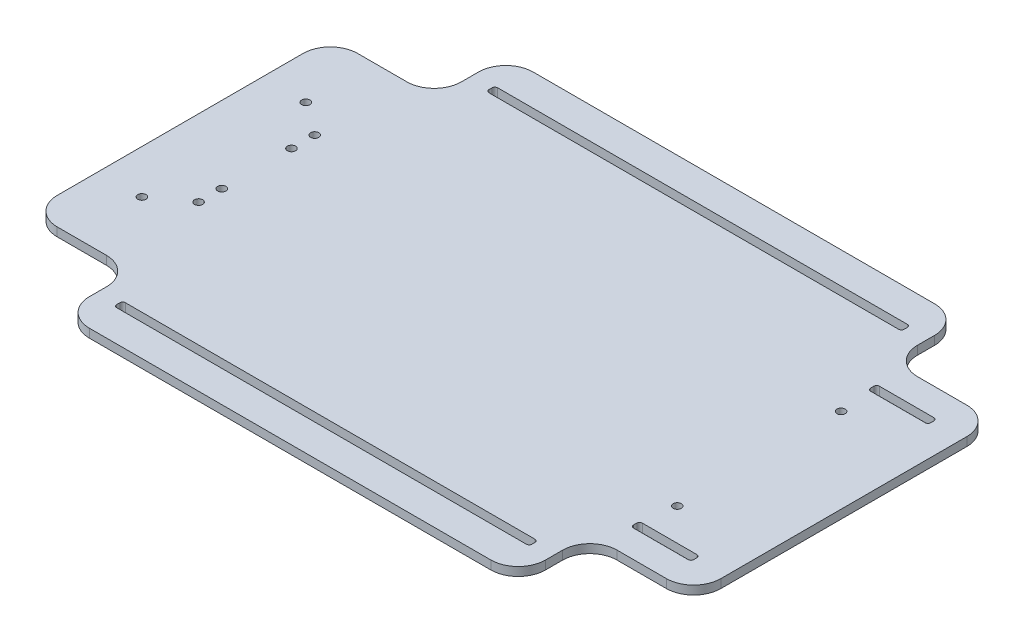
ISO-10303-21;
HEADER;
FILE_DESCRIPTION(('STEP AP214'),'2;1');
FILE_NAME('part.step','',(''),(''),'','','');
FILE_SCHEMA(('AUTOMOTIVE_DESIGN { 1 0 10303 214 1 1 1 1 }'));
ENDSEC;
DATA;
#1=APPLICATION_CONTEXT('core data for automotive mechanical design processes');
#2=APPLICATION_PROTOCOL_DEFINITION('international standard','automotive_design',2000,#1);
#3=PRODUCT_CONTEXT('',#1,'mechanical');
#4=PRODUCT('Part','Part','',(#3));
#5=PRODUCT_RELATED_PRODUCT_CATEGORY('part','',(#4));
#6=PRODUCT_DEFINITION_FORMATION('','',#4);
#7=PRODUCT_DEFINITION_CONTEXT('part definition',#1,'design');
#8=PRODUCT_DEFINITION('design','',#6,#7);
#9=PRODUCT_DEFINITION_SHAPE('','',#8);
#10=(LENGTH_UNIT() NAMED_UNIT(*) SI_UNIT(.MILLI.,.METRE.));
#11=(NAMED_UNIT(*) PLANE_ANGLE_UNIT() SI_UNIT($,.RADIAN.));
#12=(NAMED_UNIT(*) SI_UNIT($,.STERADIAN.) SOLID_ANGLE_UNIT());
#13=UNCERTAINTY_MEASURE_WITH_UNIT(LENGTH_MEASURE(1.E-05),#10,'distance_accuracy_value','');
#14=(GEOMETRIC_REPRESENTATION_CONTEXT(3) GLOBAL_UNCERTAINTY_ASSIGNED_CONTEXT((#13)) GLOBAL_UNIT_ASSIGNED_CONTEXT((#10,
#11,#12)) REPRESENTATION_CONTEXT('',''));
#15=CARTESIAN_POINT('',(0.,0.,0.));
#16=DIRECTION('',(0.,0.,1.));
#17=DIRECTION('',(1.,0.,0.));
#18=AXIS2_PLACEMENT_3D('',#15,#16,#17);
#19=CARTESIAN_POINT('',(0.,3.175,-150.97));
#20=DIRECTION('',(0.,0.,1.));
#21=DIRECTION('',(-1.,0.,0.));
#22=AXIS2_PLACEMENT_3D('',#19,#20,#21);
#23=PLANE('',#22);
#24=DIRECTION('',(1.,0.,0.));
#25=VECTOR('',#24,1.);
#26=CARTESIAN_POINT('',(0.,0.,-150.97));
#27=LINE('',#26,#25);
#28=CARTESIAN_POINT('',(46.5,0.,-150.97));
#29=VERTEX_POINT('',#28);
#30=CARTESIAN_POINT('',(196.5,0.,-150.97));
#31=VERTEX_POINT('',#30);
#32=EDGE_CURVE('E469',#29,#31,#27,.T.);
#33=ORIENTED_EDGE('',*,*,#32,.T.);
#34=DIRECTION('',(0.,-1.,0.));
#35=VECTOR('',#34,1.);
#36=CARTESIAN_POINT('',(196.5,3.175,-150.97));
#37=LINE('',#36,#35);
#38=CARTESIAN_POINT('',(196.5,3.175,-150.97));
#39=VERTEX_POINT('',#38);
#40=EDGE_CURVE('E625',#31,#39,#37,.F.);
#41=ORIENTED_EDGE('',*,*,#40,.T.);
#42=DIRECTION('',(1.,0.,0.));
#43=VECTOR('',#42,1.);
#44=CARTESIAN_POINT('',(0.,3.175,-150.97));
#45=LINE('',#44,#43);
#46=CARTESIAN_POINT('',(46.5,3.175,-150.97));
#47=VERTEX_POINT('',#46);
#48=EDGE_CURVE('E472',#47,#39,#45,.T.);
#49=ORIENTED_EDGE('',*,*,#48,.F.);
#50=DIRECTION('',(0.,-1.,0.));
#51=VECTOR('',#50,1.);
#52=CARTESIAN_POINT('',(46.5,0.,-150.97));
#53=LINE('',#52,#51);
#54=EDGE_CURVE('E622',#47,#29,#53,.T.);
#55=ORIENTED_EDGE('',*,*,#54,.T.);
#56=EDGE_LOOP('',(#33,#41,#49,#55));
#57=FACE_BOUND('',#56,.T.);
#58=ADVANCED_FACE('F35',(#57),#23,.T.);
#59=CARTESIAN_POINT('',(45.5,3.175,-162.47));
#60=DIRECTION('',(1.,0.,0.));
#61=DIRECTION('',(0.,0.,1.));
#62=AXIS2_PLACEMENT_3D('',#59,#60,#61);
#63=PLANE('',#62);
#64=DIRECTION('',(0.,0.,-1.));
#65=VECTOR('',#64,1.);
#66=CARTESIAN_POINT('',(45.5,0.,-162.47));
#67=LINE('',#66,#65);
#68=CARTESIAN_POINT('',(45.5,0.,-148.795));
#69=VERTEX_POINT('',#68);
#70=CARTESIAN_POINT('',(45.5,0.,-149.97));
#71=VERTEX_POINT('',#70);
#72=EDGE_CURVE('E463',#69,#71,#67,.T.);
#73=ORIENTED_EDGE('',*,*,#72,.T.);
#74=DIRECTION('',(0.,-1.,0.));
#75=VECTOR('',#74,1.);
#76=CARTESIAN_POINT('',(45.5,3.175,-149.97));
#77=LINE('',#76,#75);
#78=CARTESIAN_POINT('',(45.5,3.175,-149.97));
#79=VERTEX_POINT('',#78);
#80=EDGE_CURVE('E630',#71,#79,#77,.F.);
#81=ORIENTED_EDGE('',*,*,#80,.T.);
#82=DIRECTION('',(0.,0.,-1.));
#83=VECTOR('',#82,1.);
#84=CARTESIAN_POINT('',(45.5,3.175,-162.47));
#85=LINE('',#84,#83);
#86=CARTESIAN_POINT('',(45.5,3.175,-148.795));
#87=VERTEX_POINT('',#86);
#88=EDGE_CURVE('E466',#87,#79,#85,.T.);
#89=ORIENTED_EDGE('',*,*,#88,.F.);
#90=DIRECTION('',(0.,-1.,0.));
#91=VECTOR('',#90,1.);
#92=CARTESIAN_POINT('',(45.5,3.175,-148.795));
#93=LINE('',#92,#91);
#94=EDGE_CURVE('E627',#87,#69,#93,.T.);
#95=ORIENTED_EDGE('',*,*,#94,.T.);
#96=EDGE_LOOP('',(#73,#81,#89,#95));
#97=FACE_BOUND('',#96,.T.);
#98=ADVANCED_FACE('F862',(#97),#63,.T.);
#99=CARTESIAN_POINT('',(197.5,3.175,-162.47));
#100=DIRECTION('',(1.,0.,0.));
#101=DIRECTION('',(0.,0.,1.));
#102=AXIS2_PLACEMENT_3D('',#99,#100,#101);
#103=PLANE('',#102);
#104=DIRECTION('',(0.,0.,-1.));
#105=VECTOR('',#104,1.);
#106=CARTESIAN_POINT('',(197.5,0.,-162.47));
#107=LINE('',#106,#105);
#108=CARTESIAN_POINT('',(197.5,0.,-148.795));
#109=VERTEX_POINT('',#108);
#110=CARTESIAN_POINT('',(197.5,0.,-149.97));
#111=VERTEX_POINT('',#110);
#112=EDGE_CURVE('E457',#109,#111,#107,.T.);
#113=ORIENTED_EDGE('',*,*,#112,.F.);
#114=DIRECTION('',(0.,-1.,0.));
#115=VECTOR('',#114,1.);
#116=CARTESIAN_POINT('',(197.5,3.175,-148.795));
#117=LINE('',#116,#115);
#118=CARTESIAN_POINT('',(197.5,3.175,-148.795));
#119=VERTEX_POINT('',#118);
#120=EDGE_CURVE('E620',#109,#119,#117,.F.);
#121=ORIENTED_EDGE('',*,*,#120,.T.);
#122=DIRECTION('',(0.,0.,-1.));
#123=VECTOR('',#122,1.);
#124=CARTESIAN_POINT('',(197.5,3.175,-162.47));
#125=LINE('',#124,#123);
#126=CARTESIAN_POINT('',(197.5,3.175,-149.97));
#127=VERTEX_POINT('',#126);
#128=EDGE_CURVE('E460',#119,#127,#125,.T.);
#129=ORIENTED_EDGE('',*,*,#128,.T.);
#130=DIRECTION('',(0.,-1.,0.));
#131=VECTOR('',#130,1.);
#132=CARTESIAN_POINT('',(197.5,3.175,-149.97));
#133=LINE('',#132,#131);
#134=EDGE_CURVE('E617',#127,#111,#133,.T.);
#135=ORIENTED_EDGE('',*,*,#134,.T.);
#136=EDGE_LOOP('',(#113,#121,#129,#135));
#137=FACE_BOUND('',#136,.T.);
#138=ADVANCED_FACE('F868',(#137),#103,.F.);
#139=CARTESIAN_POINT('',(0.,3.175,-147.795));
#140=DIRECTION('',(0.,0.,1.));
#141=DIRECTION('',(-1.,0.,0.));
#142=AXIS2_PLACEMENT_3D('',#139,#140,#141);
#143=PLANE('',#142);
#144=DIRECTION('',(1.,0.,0.));
#145=VECTOR('',#144,1.);
#146=CARTESIAN_POINT('',(0.,3.175,-147.795));
#147=LINE('',#146,#145);
#148=CARTESIAN_POINT('',(46.5,3.175,-147.795));
#149=VERTEX_POINT('',#148);
#150=CARTESIAN_POINT('',(196.5,3.175,-147.795));
#151=VERTEX_POINT('',#150);
#152=EDGE_CURVE('E453',#149,#151,#147,.T.);
#153=ORIENTED_EDGE('',*,*,#152,.T.);
#154=DIRECTION('',(0.,-1.,0.));
#155=VECTOR('',#154,1.);
#156=CARTESIAN_POINT('',(196.5,0.,-147.795));
#157=LINE('',#156,#155);
#158=CARTESIAN_POINT('',(196.5,0.,-147.795));
#159=VERTEX_POINT('',#158);
#160=EDGE_CURVE('E614',#151,#159,#157,.T.);
#161=ORIENTED_EDGE('',*,*,#160,.T.);
#162=DIRECTION('',(1.,0.,0.));
#163=VECTOR('',#162,1.);
#164=CARTESIAN_POINT('',(0.,0.,-147.795));
#165=LINE('',#164,#163);
#166=CARTESIAN_POINT('',(46.5,0.,-147.795));
#167=VERTEX_POINT('',#166);
#168=EDGE_CURVE('E450',#167,#159,#165,.T.);
#169=ORIENTED_EDGE('',*,*,#168,.F.);
#170=DIRECTION('',(0.,-1.,0.));
#171=VECTOR('',#170,1.);
#172=CARTESIAN_POINT('',(46.5,3.175,-147.795));
#173=LINE('',#172,#171);
#174=EDGE_CURVE('E612',#167,#149,#173,.F.);
#175=ORIENTED_EDGE('',*,*,#174,.T.);
#176=EDGE_LOOP('',(#153,#161,#169,#175));
#177=FACE_BOUND('',#176,.T.);
#178=ADVANCED_FACE('F990',(#177),#143,.F.);
#179=CARTESIAN_POINT('',(0.,3.175,-14.675));
#180=DIRECTION('',(0.,0.,-1.));
#181=DIRECTION('',(-1.,0.,0.));
#182=AXIS2_PLACEMENT_3D('',#179,#180,#181);
#183=PLANE('',#182);
#184=DIRECTION('',(1.,0.,0.));
#185=VECTOR('',#184,1.);
#186=CARTESIAN_POINT('',(0.,0.,-14.675));
#187=LINE('',#186,#185);
#188=CARTESIAN_POINT('',(46.5,0.,-14.675));
#189=VERTEX_POINT('',#188);
#190=CARTESIAN_POINT('',(196.5,0.,-14.675));
#191=VERTEX_POINT('',#190);
#192=EDGE_CURVE('E437',#189,#191,#187,.T.);
#193=ORIENTED_EDGE('',*,*,#192,.T.);
#194=DIRECTION('',(0.,-1.,0.));
#195=VECTOR('',#194,1.);
#196=CARTESIAN_POINT('',(196.5,3.175,-14.675));
#197=LINE('',#196,#195);
#198=CARTESIAN_POINT('',(196.5,3.175,-14.675));
#199=VERTEX_POINT('',#198);
#200=EDGE_CURVE('E640',#191,#199,#197,.F.);
#201=ORIENTED_EDGE('',*,*,#200,.T.);
#202=DIRECTION('',(1.,0.,0.));
#203=VECTOR('',#202,1.);
#204=CARTESIAN_POINT('',(0.,3.175,-14.675));
#205=LINE('',#204,#203);
#206=CARTESIAN_POINT('',(46.5,3.175,-14.675));
#207=VERTEX_POINT('',#206);
#208=EDGE_CURVE('E719',#207,#199,#205,.T.);
#209=ORIENTED_EDGE('',*,*,#208,.F.);
#210=DIRECTION('',(0.,-1.,0.));
#211=VECTOR('',#210,1.);
#212=CARTESIAN_POINT('',(46.5,3.175,-14.675));
#213=LINE('',#212,#211);
#214=EDGE_CURVE('E637',#207,#189,#213,.T.);
#215=ORIENTED_EDGE('',*,*,#214,.T.);
#216=EDGE_LOOP('',(#193,#201,#209,#215));
#217=FACE_BOUND('',#216,.T.);
#218=ADVANCED_FACE('F722',(#217),#183,.F.);
#219=CARTESIAN_POINT('',(197.5,3.175,0.));
#220=DIRECTION('',(1.,0.,0.));
#221=DIRECTION('',(0.,0.,-1.));
#222=AXIS2_PLACEMENT_3D('',#219,#220,#221);
#223=PLANE('',#222);
#224=DIRECTION('',(0.,0.,1.));
#225=VECTOR('',#224,1.);
#226=CARTESIAN_POINT('',(197.5,3.175,0.));
#227=LINE('',#226,#225);
#228=CARTESIAN_POINT('',(197.5,3.175,-13.675));
#229=VERTEX_POINT('',#228);
#230=CARTESIAN_POINT('',(197.5,3.175,-12.5));
#231=VERTEX_POINT('',#230);
#232=EDGE_CURVE('E724',#229,#231,#227,.T.);
#233=ORIENTED_EDGE('',*,*,#232,.F.);
#234=DIRECTION('',(0.,-1.,0.));
#235=VECTOR('',#234,1.);
#236=CARTESIAN_POINT('',(197.5,0.,-13.675));
#237=LINE('',#236,#235);
#238=CARTESIAN_POINT('',(197.5,0.,-13.675));
#239=VERTEX_POINT('',#238);
#240=EDGE_CURVE('E634',#229,#239,#237,.T.);
#241=ORIENTED_EDGE('',*,*,#240,.T.);
#242=DIRECTION('',(0.,0.,1.));
#243=VECTOR('',#242,1.);
#244=CARTESIAN_POINT('',(197.5,0.,0.));
#245=LINE('',#244,#243);
#246=CARTESIAN_POINT('',(197.5,0.,-12.5));
#247=VERTEX_POINT('',#246);
#248=EDGE_CURVE('E440',#239,#247,#245,.T.);
#249=ORIENTED_EDGE('',*,*,#248,.T.);
#250=DIRECTION('',(0.,-1.,0.));
#251=VECTOR('',#250,1.);
#252=CARTESIAN_POINT('',(197.5,3.175,-12.5));
#253=LINE('',#252,#251);
#254=EDGE_CURVE('E632',#247,#231,#253,.F.);
#255=ORIENTED_EDGE('',*,*,#254,.T.);
#256=EDGE_LOOP('',(#233,#241,#249,#255));
#257=FACE_BOUND('',#256,.T.);
#258=ADVANCED_FACE('F981',(#257),#223,.F.);
#259=CARTESIAN_POINT('',(0.,3.175,-11.5));
#260=DIRECTION('',(0.,0.,-1.));
#261=DIRECTION('',(-1.,0.,0.));
#262=AXIS2_PLACEMENT_3D('',#259,#260,#261);
#263=PLANE('',#262);
#264=DIRECTION('',(1.,0.,0.));
#265=VECTOR('',#264,1.);
#266=CARTESIAN_POINT('',(0.,3.175,-11.5));
#267=LINE('',#266,#265);
#268=CARTESIAN_POINT('',(46.5,3.175,-11.5));
#269=VERTEX_POINT('',#268);
#270=CARTESIAN_POINT('',(196.5,3.175,-11.5));
#271=VERTEX_POINT('',#270);
#272=EDGE_CURVE('E728',#269,#271,#267,.T.);
#273=ORIENTED_EDGE('',*,*,#272,.T.);
#274=DIRECTION('',(0.,-1.,0.));
#275=VECTOR('',#274,1.);
#276=CARTESIAN_POINT('',(196.5,3.175,-11.5));
#277=LINE('',#276,#275);
#278=CARTESIAN_POINT('',(196.5,0.,-11.5));
#279=VERTEX_POINT('',#278);
#280=EDGE_CURVE('E644',#271,#279,#277,.T.);
#281=ORIENTED_EDGE('',*,*,#280,.T.);
#282=DIRECTION('',(1.,0.,0.));
#283=VECTOR('',#282,1.);
#284=CARTESIAN_POINT('',(0.,0.,-11.5));
#285=LINE('',#284,#283);
#286=CARTESIAN_POINT('',(46.5,0.,-11.5));
#287=VERTEX_POINT('',#286);
#288=EDGE_CURVE('E443',#287,#279,#285,.T.);
#289=ORIENTED_EDGE('',*,*,#288,.F.);
#290=DIRECTION('',(0.,-1.,0.));
#291=VECTOR('',#290,1.);
#292=CARTESIAN_POINT('',(46.5,3.175,-11.5));
#293=LINE('',#292,#291);
#294=EDGE_CURVE('E642',#287,#269,#293,.F.);
#295=ORIENTED_EDGE('',*,*,#294,.T.);
#296=EDGE_LOOP('',(#273,#281,#289,#295));
#297=FACE_BOUND('',#296,.T.);
#298=ADVANCED_FACE('F974',(#297),#263,.T.);
#299=CARTESIAN_POINT('',(0.,3.175,-39.435));
#300=DIRECTION('',(0.,0.,-1.));
#301=DIRECTION('',(-1.,0.,0.));
#302=AXIS2_PLACEMENT_3D('',#299,#300,#301);
#303=PLANE('',#302);
#304=DIRECTION('',(1.,0.,0.));
#305=VECTOR('',#304,1.);
#306=CARTESIAN_POINT('',(0.,0.,-39.435));
#307=LINE('',#306,#305);
#308=CARTESIAN_POINT('',(211.,0.,-39.435));
#309=VERTEX_POINT('',#308);
#310=CARTESIAN_POINT('',(231.,0.,-39.435));
#311=VERTEX_POINT('',#310);
#312=EDGE_CURVE('E420',#309,#311,#307,.T.);
#313=ORIENTED_EDGE('',*,*,#312,.T.);
#314=DIRECTION('',(0.,-1.,0.));
#315=VECTOR('',#314,1.);
#316=CARTESIAN_POINT('',(231.,3.175,-39.435));
#317=LINE('',#316,#315);
#318=CARTESIAN_POINT('',(231.,3.175,-39.435));
#319=VERTEX_POINT('',#318);
#320=EDGE_CURVE('E590',#311,#319,#317,.F.);
#321=ORIENTED_EDGE('',*,*,#320,.T.);
#322=DIRECTION('',(1.,0.,0.));
#323=VECTOR('',#322,1.);
#324=CARTESIAN_POINT('',(0.,3.175,-39.435));
#325=LINE('',#324,#323);
#326=CARTESIAN_POINT('',(211.,3.175,-39.435));
#327=VERTEX_POINT('',#326);
#328=EDGE_CURVE('E804',#327,#319,#325,.T.);
#329=ORIENTED_EDGE('',*,*,#328,.F.);
#330=DIRECTION('',(0.,-1.,0.));
#331=VECTOR('',#330,1.);
#332=CARTESIAN_POINT('',(211.,3.175,-39.435));
#333=LINE('',#332,#331);
#334=EDGE_CURVE('E587',#327,#309,#333,.T.);
#335=ORIENTED_EDGE('',*,*,#334,.T.);
#336=EDGE_LOOP('',(#313,#321,#329,#335));
#337=FACE_BOUND('',#336,.T.);
#338=ADVANCED_FACE('F832',(#337),#303,.F.);
#339=CARTESIAN_POINT('',(232.,3.175,0.));
#340=DIRECTION('',(1.,0.,0.));
#341=DIRECTION('',(0.,0.,-1.));
#342=AXIS2_PLACEMENT_3D('',#339,#340,#341);
#343=PLANE('',#342);
#344=DIRECTION('',(0.,0.,1.));
#345=VECTOR('',#344,1.);
#346=CARTESIAN_POINT('',(232.,0.,0.));
#347=LINE('',#346,#345);
#348=CARTESIAN_POINT('',(232.,0.,-38.435));
#349=VERTEX_POINT('',#348);
#350=CARTESIAN_POINT('',(232.,0.,-37.2350000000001));
#351=VERTEX_POINT('',#350);
#352=EDGE_CURVE('E428',#349,#351,#347,.T.);
#353=ORIENTED_EDGE('',*,*,#352,.T.);
#354=DIRECTION('',(0.,-1.,0.));
#355=VECTOR('',#354,1.);
#356=CARTESIAN_POINT('',(232.,3.175,-37.2350000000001));
#357=LINE('',#356,#355);
#358=CARTESIAN_POINT('',(232.,3.175,-37.2350000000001));
#359=VERTEX_POINT('',#358);
#360=EDGE_CURVE('E585',#351,#359,#357,.F.);
#361=ORIENTED_EDGE('',*,*,#360,.T.);
#362=DIRECTION('',(0.,0.,1.));
#363=VECTOR('',#362,1.);
#364=CARTESIAN_POINT('',(232.,3.175,0.));
#365=LINE('',#364,#363);
#366=CARTESIAN_POINT('',(232.,3.175,-38.435));
#367=VERTEX_POINT('',#366);
#368=EDGE_CURVE('E807',#367,#359,#365,.T.);
#369=ORIENTED_EDGE('',*,*,#368,.F.);
#370=DIRECTION('',(0.,-1.,0.));
#371=VECTOR('',#370,1.);
#372=CARTESIAN_POINT('',(232.,0.,-38.435));
#373=LINE('',#372,#371);
#374=EDGE_CURVE('E582',#367,#349,#373,.T.);
#375=ORIENTED_EDGE('',*,*,#374,.T.);
#376=EDGE_LOOP('',(#353,#361,#369,#375));
#377=FACE_BOUND('',#376,.T.);
#378=ADVANCED_FACE('F824',(#377),#343,.F.);
#379=CARTESIAN_POINT('',(0.,3.175,-36.235));
#380=DIRECTION('',(0.,0.,-1.));
#381=DIRECTION('',(-1.,0.,0.));
#382=AXIS2_PLACEMENT_3D('',#379,#380,#381);
#383=PLANE('',#382);
#384=DIRECTION('',(1.,0.,0.));
#385=VECTOR('',#384,1.);
#386=CARTESIAN_POINT('',(0.,0.,-36.235));
#387=LINE('',#386,#385);
#388=CARTESIAN_POINT('',(211.,0.,-36.235));
#389=VERTEX_POINT('',#388);
#390=CARTESIAN_POINT('',(231.,0.,-36.235));
#391=VERTEX_POINT('',#390);
#392=EDGE_CURVE('E431',#389,#391,#387,.T.);
#393=ORIENTED_EDGE('',*,*,#392,.F.);
#394=DIRECTION('',(0.,-1.,0.));
#395=VECTOR('',#394,1.);
#396=CARTESIAN_POINT('',(211.,3.175,-36.235));
#397=LINE('',#396,#395);
#398=CARTESIAN_POINT('',(211.,3.175,-36.235));
#399=VERTEX_POINT('',#398);
#400=EDGE_CURVE('E580',#389,#399,#397,.F.);
#401=ORIENTED_EDGE('',*,*,#400,.T.);
#402=DIRECTION('',(1.,0.,0.));
#403=VECTOR('',#402,1.);
#404=CARTESIAN_POINT('',(0.,3.175,-36.235));
#405=LINE('',#404,#403);
#406=CARTESIAN_POINT('',(231.,3.175,-36.235));
#407=VERTEX_POINT('',#406);
#408=EDGE_CURVE('E731',#399,#407,#405,.T.);
#409=ORIENTED_EDGE('',*,*,#408,.T.);
#410=DIRECTION('',(0.,-1.,0.));
#411=VECTOR('',#410,1.);
#412=CARTESIAN_POINT('',(231.,3.175,-36.235));
#413=LINE('',#412,#411);
#414=EDGE_CURVE('E577',#407,#391,#413,.T.);
#415=ORIENTED_EDGE('',*,*,#414,.T.);
#416=EDGE_LOOP('',(#393,#401,#409,#415));
#417=FACE_BOUND('',#416,.T.);
#418=ADVANCED_FACE('F814',(#417),#383,.T.);
#419=CARTESIAN_POINT('',(0.,3.175,0.));
#420=DIRECTION('',(-1.,0.,0.));
#421=DIRECTION('',(0.,0.,1.));
#422=AXIS2_PLACEMENT_3D('',#419,#420,#421);
#423=PLANE('',#422);
#424=DIRECTION('',(0.,0.,-1.));
#425=VECTOR('',#424,1.);
#426=CARTESIAN_POINT('',(0.,3.175,0.));
#427=LINE('',#426,#425);
#428=CARTESIAN_POINT('',(0.,3.175,-36.2350000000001));
#429=VERTEX_POINT('',#428);
#430=CARTESIAN_POINT('',(0.,3.175,-126.235));
#431=VERTEX_POINT('',#430);
#432=EDGE_CURVE('E1113',#429,#431,#427,.T.);
#433=ORIENTED_EDGE('',*,*,#432,.T.);
#434=DIRECTION('',(0.,-1.,0.));
#435=VECTOR('',#434,1.);
#436=CARTESIAN_POINT('',(0.,3.175,-126.235));
#437=LINE('',#436,#435);
#438=CARTESIAN_POINT('',(0.,0.,-126.235));
#439=VERTEX_POINT('',#438);
#440=EDGE_CURVE('E514',#431,#439,#437,.T.);
#441=ORIENTED_EDGE('',*,*,#440,.T.);
#442=DIRECTION('',(0.,0.,-1.));
#443=VECTOR('',#442,1.);
#444=CARTESIAN_POINT('',(0.,0.,0.));
#445=LINE('',#444,#443);
#446=CARTESIAN_POINT('',(0.,0.,-36.2350000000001));
#447=VERTEX_POINT('',#446);
#448=EDGE_CURVE('E751',#447,#439,#445,.T.);
#449=ORIENTED_EDGE('',*,*,#448,.F.);
#450=DIRECTION('',(0.,-1.,0.));
#451=VECTOR('',#450,1.);
#452=CARTESIAN_POINT('',(0.,3.175,-36.2350000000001));
#453=LINE('',#452,#451);
#454=EDGE_CURVE('E512',#447,#429,#453,.F.);
#455=ORIENTED_EDGE('',*,*,#454,.T.);
#456=EDGE_LOOP('',(#433,#441,#449,#455));
#457=FACE_BOUND('',#456,.T.);
#458=ADVANCED_FACE('F999',(#457),#423,.T.);
#459=CARTESIAN_POINT('',(0.,3.175,-26.2350000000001));
#460=DIRECTION('',(0.,0.,-1.));
#461=DIRECTION('',(-1.,0.,0.));
#462=AXIS2_PLACEMENT_3D('',#459,#460,#461);
#463=PLANE('',#462);
#464=DIRECTION('',(1.,0.,0.));
#465=VECTOR('',#464,1.);
#466=CARTESIAN_POINT('',(0.,0.,-26.2350000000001));
#467=LINE('',#466,#465);
#468=CARTESIAN_POINT('',(10.,0.,-26.2350000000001));
#469=VERTEX_POINT('',#468);
#470=CARTESIAN_POINT('',(28.,0.,-26.2350000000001));
#471=VERTEX_POINT('',#470);
#472=EDGE_CURVE('E754',#469,#471,#467,.T.);
#473=ORIENTED_EDGE('',*,*,#472,.T.);
#474=DIRECTION('',(0.,-1.,0.));
#475=VECTOR('',#474,1.);
#476=CARTESIAN_POINT('',(28.,3.175,-26.2350000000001));
#477=LINE('',#476,#475);
#478=CARTESIAN_POINT('',(28.,3.175,-26.2350000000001));
#479=VERTEX_POINT('',#478);
#480=EDGE_CURVE('E555',#471,#479,#477,.F.);
#481=ORIENTED_EDGE('',*,*,#480,.T.);
#482=DIRECTION('',(1.,0.,0.));
#483=VECTOR('',#482,1.);
#484=CARTESIAN_POINT('',(0.,3.175,-26.2350000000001));
#485=LINE('',#484,#483);
#486=CARTESIAN_POINT('',(10.,3.175,-26.2350000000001));
#487=VERTEX_POINT('',#486);
#488=EDGE_CURVE('E1116',#487,#479,#485,.T.);
#489=ORIENTED_EDGE('',*,*,#488,.F.);
#490=DIRECTION('',(0.,-1.,0.));
#491=VECTOR('',#490,1.);
#492=CARTESIAN_POINT('',(10.,0.,-26.2350000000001));
#493=LINE('',#492,#491);
#494=EDGE_CURVE('E552',#487,#469,#493,.T.);
#495=ORIENTED_EDGE('',*,*,#494,.T.);
#496=EDGE_LOOP('',(#473,#481,#489,#495));
#497=FACE_BOUND('',#496,.T.);
#498=ADVANCED_FACE('F1037',(#497),#463,.F.);
#499=CARTESIAN_POINT('',(38.,3.175,0.));
#500=DIRECTION('',(-1.,0.,0.));
#501=DIRECTION('',(0.,0.,1.));
#502=AXIS2_PLACEMENT_3D('',#499,#500,#501);
#503=PLANE('',#502);
#504=DIRECTION('',(0.,0.,-1.));
#505=VECTOR('',#504,1.);
#506=CARTESIAN_POINT('',(38.,0.,0.));
#507=LINE('',#506,#505);
#508=CARTESIAN_POINT('',(38.,0.,-10.));
#509=VERTEX_POINT('',#508);
#510=CARTESIAN_POINT('',(38.,0.,-16.2350000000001));
#511=VERTEX_POINT('',#510);
#512=EDGE_CURVE('E757',#509,#511,#507,.T.);
#513=ORIENTED_EDGE('',*,*,#512,.F.);
#514=DIRECTION('',(0.,-1.,0.));
#515=VECTOR('',#514,1.);
#516=CARTESIAN_POINT('',(38.,3.175,-10.));
#517=LINE('',#516,#515);
#518=CARTESIAN_POINT('',(38.,3.175,-10.));
#519=VERTEX_POINT('',#518);
#520=EDGE_CURVE('E550',#509,#519,#517,.F.);
#521=ORIENTED_EDGE('',*,*,#520,.T.);
#522=DIRECTION('',(0.,0.,-1.));
#523=VECTOR('',#522,1.);
#524=CARTESIAN_POINT('',(38.,3.175,0.));
#525=LINE('',#524,#523);
#526=CARTESIAN_POINT('',(38.,3.175,-16.2350000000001));
#527=VERTEX_POINT('',#526);
#528=EDGE_CURVE('E1119',#519,#527,#525,.T.);
#529=ORIENTED_EDGE('',*,*,#528,.T.);
#530=DIRECTION('',(0.,-1.,0.));
#531=VECTOR('',#530,1.);
#532=CARTESIAN_POINT('',(38.,3.175,-16.2350000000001));
#533=LINE('',#532,#531);
#534=EDGE_CURVE('E547',#527,#511,#533,.T.);
#535=ORIENTED_EDGE('',*,*,#534,.T.);
#536=EDGE_LOOP('',(#513,#521,#529,#535));
#537=FACE_BOUND('',#536,.T.);
#538=ADVANCED_FACE('F1033',(#537),#503,.T.);
#539=CARTESIAN_POINT('',(0.,3.175,0.));
#540=DIRECTION('',(0.,0.,-1.));
#541=DIRECTION('',(-1.,0.,0.));
#542=AXIS2_PLACEMENT_3D('',#539,#540,#541);
#543=PLANE('',#542);
#544=DIRECTION('',(1.,0.,0.));
#545=VECTOR('',#544,1.);
#546=CARTESIAN_POINT('',(0.,0.,0.));
#547=LINE('',#546,#545);
#548=CARTESIAN_POINT('',(48.,0.,0.));
#549=VERTEX_POINT('',#548);
#550=CARTESIAN_POINT('',(195.,0.,0.));
#551=VERTEX_POINT('',#550);
#552=EDGE_CURVE('E760',#549,#551,#547,.T.);
#553=ORIENTED_EDGE('',*,*,#552,.T.);
#554=DIRECTION('',(0.,-1.,0.));
#555=VECTOR('',#554,1.);
#556=CARTESIAN_POINT('',(195.,3.175,0.));
#557=LINE('',#556,#555);
#558=CARTESIAN_POINT('',(195.,3.175,0.));
#559=VERTEX_POINT('',#558);
#560=EDGE_CURVE('E545',#551,#559,#557,.F.);
#561=ORIENTED_EDGE('',*,*,#560,.T.);
#562=DIRECTION('',(1.,0.,0.));
#563=VECTOR('',#562,1.);
#564=CARTESIAN_POINT('',(0.,3.175,0.));
#565=LINE('',#564,#563);
#566=CARTESIAN_POINT('',(48.,3.175,0.));
#567=VERTEX_POINT('',#566);
#568=EDGE_CURVE('E1122',#567,#559,#565,.T.);
#569=ORIENTED_EDGE('',*,*,#568,.F.);
#570=DIRECTION('',(0.,-1.,0.));
#571=VECTOR('',#570,1.);
#572=CARTESIAN_POINT('',(48.,0.,0.));
#573=LINE('',#572,#571);
#574=EDGE_CURVE('E542',#567,#549,#573,.T.);
#575=ORIENTED_EDGE('',*,*,#574,.T.);
#576=EDGE_LOOP('',(#553,#561,#569,#575));
#577=FACE_BOUND('',#576,.T.);
#578=ADVANCED_FACE('F1029',(#577),#543,.F.);
#579=CARTESIAN_POINT('',(205.,3.175,0.));
#580=DIRECTION('',(-1.,0.,0.));
#581=DIRECTION('',(0.,0.,1.));
#582=AXIS2_PLACEMENT_3D('',#579,#580,#581);
#583=PLANE('',#582);
#584=DIRECTION('',(0.,0.,-1.));
#585=VECTOR('',#584,1.);
#586=CARTESIAN_POINT('',(205.,0.,0.));
#587=LINE('',#586,#585);
#588=CARTESIAN_POINT('',(205.,0.,-10.));
#589=VERTEX_POINT('',#588);
#590=CARTESIAN_POINT('',(205.,0.,-16.2350000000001));
#591=VERTEX_POINT('',#590);
#592=EDGE_CURVE('E763',#589,#591,#587,.T.);
#593=ORIENTED_EDGE('',*,*,#592,.T.);
#594=DIRECTION('',(0.,-1.,0.));
#595=VECTOR('',#594,1.);
#596=CARTESIAN_POINT('',(205.,3.175,-16.2350000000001));
#597=LINE('',#596,#595);
#598=CARTESIAN_POINT('',(205.,3.175,-16.2350000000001));
#599=VERTEX_POINT('',#598);
#600=EDGE_CURVE('E540',#591,#599,#597,.F.);
#601=ORIENTED_EDGE('',*,*,#600,.T.);
#602=DIRECTION('',(0.,0.,-1.));
#603=VECTOR('',#602,1.);
#604=CARTESIAN_POINT('',(205.,3.175,0.));
#605=LINE('',#604,#603);
#606=CARTESIAN_POINT('',(205.,3.175,-10.));
#607=VERTEX_POINT('',#606);
#608=EDGE_CURVE('E1125',#607,#599,#605,.T.);
#609=ORIENTED_EDGE('',*,*,#608,.F.);
#610=DIRECTION('',(0.,-1.,0.));
#611=VECTOR('',#610,1.);
#612=CARTESIAN_POINT('',(205.,3.175,-10.));
#613=LINE('',#612,#611);
#614=EDGE_CURVE('E537',#607,#589,#613,.T.);
#615=ORIENTED_EDGE('',*,*,#614,.T.);
#616=EDGE_LOOP('',(#593,#601,#609,#615));
#617=FACE_BOUND('',#616,.T.);
#618=ADVANCED_FACE('F1025',(#617),#583,.F.);
#619=CARTESIAN_POINT('',(0.,3.175,-26.235));
#620=DIRECTION('',(0.,0.,1.));
#621=DIRECTION('',(1.,0.,0.));
#622=AXIS2_PLACEMENT_3D('',#619,#620,#621);
#623=PLANE('',#622);
#624=DIRECTION('',(-1.,0.,0.));
#625=VECTOR('',#624,1.);
#626=CARTESIAN_POINT('',(0.,0.,-26.235));
#627=LINE('',#626,#625);
#628=CARTESIAN_POINT('',(233.,0.,-26.2350000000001));
#629=VERTEX_POINT('',#628);
#630=CARTESIAN_POINT('',(215.,0.,-26.2350000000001));
#631=VERTEX_POINT('',#630);
#632=EDGE_CURVE('E766',#629,#631,#627,.T.);
#633=ORIENTED_EDGE('',*,*,#632,.F.);
#634=DIRECTION('',(0.,-1.,0.));
#635=VECTOR('',#634,1.);
#636=CARTESIAN_POINT('',(233.,3.175,-26.2350000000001));
#637=LINE('',#636,#635);
#638=CARTESIAN_POINT('',(233.,3.175,-26.2350000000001));
#639=VERTEX_POINT('',#638);
#640=EDGE_CURVE('E535',#629,#639,#637,.F.);
#641=ORIENTED_EDGE('',*,*,#640,.T.);
#642=DIRECTION('',(-1.,0.,0.));
#643=VECTOR('',#642,1.);
#644=CARTESIAN_POINT('',(0.,3.175,-26.235));
#645=LINE('',#644,#643);
#646=CARTESIAN_POINT('',(215.,3.175,-26.2350000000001));
#647=VERTEX_POINT('',#646);
#648=EDGE_CURVE('E1128',#639,#647,#645,.T.);
#649=ORIENTED_EDGE('',*,*,#648,.T.);
#650=DIRECTION('',(0.,-1.,0.));
#651=VECTOR('',#650,1.);
#652=CARTESIAN_POINT('',(215.,3.175,-26.2350000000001));
#653=LINE('',#652,#651);
#654=EDGE_CURVE('E532',#647,#631,#653,.T.);
#655=ORIENTED_EDGE('',*,*,#654,.T.);
#656=EDGE_LOOP('',(#633,#641,#649,#655));
#657=FACE_BOUND('',#656,.T.);
#658=ADVANCED_FACE('F1021',(#657),#623,.T.);
#659=CARTESIAN_POINT('',(243.,3.175,0.));
#660=DIRECTION('',(-1.,0.,0.));
#661=DIRECTION('',(0.,0.,1.));
#662=AXIS2_PLACEMENT_3D('',#659,#660,#661);
#663=PLANE('',#662);
#664=DIRECTION('',(0.,0.,-1.));
#665=VECTOR('',#664,1.);
#666=CARTESIAN_POINT('',(243.,0.,0.));
#667=LINE('',#666,#665);
#668=CARTESIAN_POINT('',(243.,0.,-36.235));
#669=VERTEX_POINT('',#668);
#670=CARTESIAN_POINT('',(243.,0.,-126.235));
#671=VERTEX_POINT('',#670);
#672=EDGE_CURVE('E769',#669,#671,#667,.T.);
#673=ORIENTED_EDGE('',*,*,#672,.T.);
#674=DIRECTION('',(0.,-1.,0.));
#675=VECTOR('',#674,1.);
#676=CARTESIAN_POINT('',(243.,3.175,-126.235));
#677=LINE('',#676,#675);
#678=CARTESIAN_POINT('',(243.,3.175,-126.235));
#679=VERTEX_POINT('',#678);
#680=EDGE_CURVE('E530',#671,#679,#677,.F.);
#681=ORIENTED_EDGE('',*,*,#680,.T.);
#682=DIRECTION('',(0.,0.,-1.));
#683=VECTOR('',#682,1.);
#684=CARTESIAN_POINT('',(243.,3.175,0.));
#685=LINE('',#684,#683);
#686=CARTESIAN_POINT('',(243.,3.175,-36.235));
#687=VERTEX_POINT('',#686);
#688=EDGE_CURVE('E1131',#687,#679,#685,.T.);
#689=ORIENTED_EDGE('',*,*,#688,.F.);
#690=DIRECTION('',(0.,-1.,0.));
#691=VECTOR('',#690,1.);
#692=CARTESIAN_POINT('',(243.,0.,-36.235));
#693=LINE('',#692,#691);
#694=EDGE_CURVE('E527',#687,#669,#693,.T.);
#695=ORIENTED_EDGE('',*,*,#694,.T.);
#696=EDGE_LOOP('',(#673,#681,#689,#695));
#697=FACE_BOUND('',#696,.T.);
#698=ADVANCED_FACE('F1017',(#697),#663,.F.);
#699=CARTESIAN_POINT('',(0.,3.175,-136.235));
#700=DIRECTION('',(0.,0.,1.));
#701=DIRECTION('',(1.,0.,0.));
#702=AXIS2_PLACEMENT_3D('',#699,#700,#701);
#703=PLANE('',#702);
#704=DIRECTION('',(-1.,0.,0.));
#705=VECTOR('',#704,1.);
#706=CARTESIAN_POINT('',(0.,0.,-136.235));
#707=LINE('',#706,#705);
#708=CARTESIAN_POINT('',(233.,0.,-136.235));
#709=VERTEX_POINT('',#708);
#710=CARTESIAN_POINT('',(215.,0.,-136.235));
#711=VERTEX_POINT('',#710);
#712=EDGE_CURVE('E772',#709,#711,#707,.T.);
#713=ORIENTED_EDGE('',*,*,#712,.T.);
#714=DIRECTION('',(0.,-1.,0.));
#715=VECTOR('',#714,1.);
#716=CARTESIAN_POINT('',(215.,3.175,-136.235));
#717=LINE('',#716,#715);
#718=CARTESIAN_POINT('',(215.,3.175,-136.235));
#719=VERTEX_POINT('',#718);
#720=EDGE_CURVE('E525',#711,#719,#717,.F.);
#721=ORIENTED_EDGE('',*,*,#720,.T.);
#722=DIRECTION('',(-1.,0.,0.));
#723=VECTOR('',#722,1.);
#724=CARTESIAN_POINT('',(0.,3.175,-136.235));
#725=LINE('',#724,#723);
#726=CARTESIAN_POINT('',(233.,3.175,-136.235));
#727=VERTEX_POINT('',#726);
#728=EDGE_CURVE('E798',#727,#719,#725,.T.);
#729=ORIENTED_EDGE('',*,*,#728,.F.);
#730=DIRECTION('',(0.,-1.,0.));
#731=VECTOR('',#730,1.);
#732=CARTESIAN_POINT('',(233.,3.175,-136.235));
#733=LINE('',#732,#731);
#734=EDGE_CURVE('E522',#727,#709,#733,.T.);
#735=ORIENTED_EDGE('',*,*,#734,.T.);
#736=EDGE_LOOP('',(#713,#721,#729,#735));
#737=FACE_BOUND('',#736,.T.);
#738=ADVANCED_FACE('F1014',(#737),#703,.F.);
#739=CARTESIAN_POINT('',(205.,3.175,-2.16881761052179E-13));
#740=DIRECTION('',(1.,0.,0.));
#741=DIRECTION('',(0.,0.,-1.));
#742=AXIS2_PLACEMENT_3D('',#739,#740,#741);
#743=PLANE('',#742);
#744=DIRECTION('',(0.,0.,1.));
#745=VECTOR('',#744,1.);
#746=CARTESIAN_POINT('',(205.,0.,-2.16881761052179E-13));
#747=LINE('',#746,#745);
#748=CARTESIAN_POINT('',(205.,0.,-152.47));
#749=VERTEX_POINT('',#748);
#750=CARTESIAN_POINT('',(205.,0.,-146.235));
#751=VERTEX_POINT('',#750);
#752=EDGE_CURVE('E422',#749,#751,#747,.T.);
#753=ORIENTED_EDGE('',*,*,#752,.F.);
#754=DIRECTION('',(0.,-1.,0.));
#755=VECTOR('',#754,1.);
#756=CARTESIAN_POINT('',(205.,3.175,-152.47));
#757=LINE('',#756,#755);
#758=CARTESIAN_POINT('',(205.,3.175,-152.47));
#759=VERTEX_POINT('',#758);
#760=EDGE_CURVE('E520',#749,#759,#757,.F.);
#761=ORIENTED_EDGE('',*,*,#760,.T.);
#762=DIRECTION('',(0.,0.,1.));
#763=VECTOR('',#762,1.);
#764=CARTESIAN_POINT('',(205.,3.175,-2.16881761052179E-13));
#765=LINE('',#764,#763);
#766=CARTESIAN_POINT('',(205.,3.175,-146.235));
#767=VERTEX_POINT('',#766);
#768=EDGE_CURVE('E792',#759,#767,#765,.T.);
#769=ORIENTED_EDGE('',*,*,#768,.T.);
#770=DIRECTION('',(0.,-1.,0.));
#771=VECTOR('',#770,1.);
#772=CARTESIAN_POINT('',(205.,3.175,-146.235));
#773=LINE('',#772,#771);
#774=EDGE_CURVE('E517',#767,#751,#773,.T.);
#775=ORIENTED_EDGE('',*,*,#774,.T.);
#776=EDGE_LOOP('',(#753,#761,#769,#775));
#777=FACE_BOUND('',#776,.T.);
#778=ADVANCED_FACE('F779',(#777),#743,.T.);
#779=CARTESIAN_POINT('',(0.,3.175,-162.47));
#780=DIRECTION('',(0.,0.,-1.));
#781=DIRECTION('',(-1.,0.,0.));
#782=AXIS2_PLACEMENT_3D('',#779,#780,#781);
#783=PLANE('',#782);
#784=DIRECTION('',(1.,0.,0.));
#785=VECTOR('',#784,1.);
#786=CARTESIAN_POINT('',(0.,0.,-162.47));
#787=LINE('',#786,#785);
#788=CARTESIAN_POINT('',(48.,0.,-162.47));
#789=VERTEX_POINT('',#788);
#790=CARTESIAN_POINT('',(195.,0.,-162.47));
#791=VERTEX_POINT('',#790);
#792=EDGE_CURVE('E418',#789,#791,#787,.T.);
#793=ORIENTED_EDGE('',*,*,#792,.F.);
#794=DIRECTION('',(0.,-1.,0.));
#795=VECTOR('',#794,1.);
#796=CARTESIAN_POINT('',(48.,3.175,-162.47));
#797=LINE('',#796,#795);
#798=CARTESIAN_POINT('',(48.,3.175,-162.47));
#799=VERTEX_POINT('',#798);
#800=EDGE_CURVE('E394',#789,#799,#797,.F.);
#801=ORIENTED_EDGE('',*,*,#800,.T.);
#802=DIRECTION('',(1.,0.,0.));
#803=VECTOR('',#802,1.);
#804=CARTESIAN_POINT('',(0.,3.175,-162.47));
#805=LINE('',#804,#803);
#806=CARTESIAN_POINT('',(195.,3.175,-162.47));
#807=VERTEX_POINT('',#806);
#808=EDGE_CURVE('E791',#799,#807,#805,.T.);
#809=ORIENTED_EDGE('',*,*,#808,.T.);
#810=DIRECTION('',(0.,-1.,0.));
#811=VECTOR('',#810,1.);
#812=CARTESIAN_POINT('',(195.,3.175,-162.47));
#813=LINE('',#812,#811);
#814=EDGE_CURVE('E399',#807,#791,#813,.T.);
#815=ORIENTED_EDGE('',*,*,#814,.T.);
#816=EDGE_LOOP('',(#793,#801,#809,#815));
#817=FACE_BOUND('',#816,.T.);
#818=ADVANCED_FACE('F794',(#817),#783,.T.);
#819=CARTESIAN_POINT('',(38.,3.175,0.));
#820=DIRECTION('',(1.,0.,0.));
#821=DIRECTION('',(0.,0.,-1.));
#822=AXIS2_PLACEMENT_3D('',#819,#820,#821);
#823=PLANE('',#822);
#824=DIRECTION('',(0.,0.,1.));
#825=VECTOR('',#824,1.);
#826=CARTESIAN_POINT('',(38.,3.175,0.));
#827=LINE('',#826,#825);
#828=CARTESIAN_POINT('',(38.,3.175,-152.47));
#829=VERTEX_POINT('',#828);
#830=CARTESIAN_POINT('',(38.,3.175,-146.235));
#831=VERTEX_POINT('',#830);
#832=EDGE_CURVE('E409',#829,#831,#827,.T.);
#833=ORIENTED_EDGE('',*,*,#832,.F.);
#834=DIRECTION('',(0.,-1.,0.));
#835=VECTOR('',#834,1.);
#836=CARTESIAN_POINT('',(38.,0.,-152.47));
#837=LINE('',#836,#835);
#838=CARTESIAN_POINT('',(38.,0.,-152.47));
#839=VERTEX_POINT('',#838);
#840=EDGE_CURVE('E393',#829,#839,#837,.T.);
#841=ORIENTED_EDGE('',*,*,#840,.T.);
#842=DIRECTION('',(0.,0.,1.));
#843=VECTOR('',#842,1.);
#844=CARTESIAN_POINT('',(38.,0.,0.));
#845=LINE('',#844,#843);
#846=CARTESIAN_POINT('',(38.,0.,-146.235));
#847=VERTEX_POINT('',#846);
#848=EDGE_CURVE('E406',#839,#847,#845,.T.);
#849=ORIENTED_EDGE('',*,*,#848,.T.);
#850=DIRECTION('',(0.,-1.,0.));
#851=VECTOR('',#850,1.);
#852=CARTESIAN_POINT('',(38.,3.175,-146.235));
#853=LINE('',#852,#851);
#854=EDGE_CURVE('E411',#847,#831,#853,.F.);
#855=ORIENTED_EDGE('',*,*,#854,.T.);
#856=EDGE_LOOP('',(#833,#841,#849,#855));
#857=FACE_BOUND('',#856,.T.);
#858=ADVANCED_FACE('F405',(#857),#823,.F.);
#859=CARTESIAN_POINT('',(0.,3.175,-126.235));
#860=DIRECTION('',(0.,0.,-1.));
#861=DIRECTION('',(-1.,0.,0.));
#862=AXIS2_PLACEMENT_3D('',#859,#860,#861);
#863=PLANE('',#862);
#864=DIRECTION('',(1.,0.,0.));
#865=VECTOR('',#864,1.);
#866=CARTESIAN_POINT('',(0.,3.175,-126.235));
#867=LINE('',#866,#865);
#868=CARTESIAN_POINT('',(211.,3.175,-126.235));
#869=VERTEX_POINT('',#868);
#870=CARTESIAN_POINT('',(231.,3.175,-126.235));
#871=VERTEX_POINT('',#870);
#872=EDGE_CURVE('E449',#869,#871,#867,.T.);
#873=ORIENTED_EDGE('',*,*,#872,.F.);
#874=DIRECTION('',(0.,-1.,0.));
#875=VECTOR('',#874,1.);
#876=CARTESIAN_POINT('',(211.,3.175,-126.235));
#877=LINE('',#876,#875);
#878=CARTESIAN_POINT('',(211.,0.,-126.235));
#879=VERTEX_POINT('',#878);
#880=EDGE_CURVE('E594',#869,#879,#877,.T.);
#881=ORIENTED_EDGE('',*,*,#880,.T.);
#882=DIRECTION('',(1.,0.,0.));
#883=VECTOR('',#882,1.);
#884=CARTESIAN_POINT('',(0.,0.,-126.235));
#885=LINE('',#884,#883);
#886=CARTESIAN_POINT('',(231.,0.,-126.235));
#887=VERTEX_POINT('',#886);
#888=EDGE_CURVE('E738',#879,#887,#885,.T.);
#889=ORIENTED_EDGE('',*,*,#888,.T.);
#890=DIRECTION('',(0.,-1.,0.));
#891=VECTOR('',#890,1.);
#892=CARTESIAN_POINT('',(231.,3.175,-126.235));
#893=LINE('',#892,#891);
#894=EDGE_CURVE('E592',#887,#871,#893,.F.);
#895=ORIENTED_EDGE('',*,*,#894,.T.);
#896=EDGE_LOOP('',(#873,#881,#889,#895));
#897=FACE_BOUND('',#896,.T.);
#898=ADVANCED_FACE('F1009',(#897),#863,.F.);
#899=CARTESIAN_POINT('',(232.,3.175,0.));
#900=DIRECTION('',(1.,0.,0.));
#901=DIRECTION('',(0.,0.,-1.));
#902=AXIS2_PLACEMENT_3D('',#899,#900,#901);
#903=PLANE('',#902);
#904=DIRECTION('',(0.,0.,1.));
#905=VECTOR('',#904,1.);
#906=CARTESIAN_POINT('',(232.,3.175,0.));
#907=LINE('',#906,#905);
#908=CARTESIAN_POINT('',(232.,3.175,-125.235));
#909=VERTEX_POINT('',#908);
#910=CARTESIAN_POINT('',(232.,3.175,-124.035));
#911=VERTEX_POINT('',#910);
#912=EDGE_CURVE('E1100',#909,#911,#907,.T.);
#913=ORIENTED_EDGE('',*,*,#912,.F.);
#914=DIRECTION('',(0.,-1.,0.));
#915=VECTOR('',#914,1.);
#916=CARTESIAN_POINT('',(232.,0.,-125.235));
#917=LINE('',#916,#915);
#918=CARTESIAN_POINT('',(232.,0.,-125.235));
#919=VERTEX_POINT('',#918);
#920=EDGE_CURVE('E604',#909,#919,#917,.T.);
#921=ORIENTED_EDGE('',*,*,#920,.T.);
#922=DIRECTION('',(0.,0.,1.));
#923=VECTOR('',#922,1.);
#924=CARTESIAN_POINT('',(232.,0.,0.));
#925=LINE('',#924,#923);
#926=CARTESIAN_POINT('',(232.,0.,-124.035));
#927=VERTEX_POINT('',#926);
#928=EDGE_CURVE('E741',#919,#927,#925,.T.);
#929=ORIENTED_EDGE('',*,*,#928,.T.);
#930=DIRECTION('',(0.,-1.,0.));
#931=VECTOR('',#930,1.);
#932=CARTESIAN_POINT('',(232.,3.175,-124.035));
#933=LINE('',#932,#931);
#934=EDGE_CURVE('E602',#927,#911,#933,.F.);
#935=ORIENTED_EDGE('',*,*,#934,.T.);
#936=EDGE_LOOP('',(#913,#921,#929,#935));
#937=FACE_BOUND('',#936,.T.);
#938=ADVANCED_FACE('F1050',(#937),#903,.F.);
#939=CARTESIAN_POINT('',(0.,3.175,-123.035));
#940=DIRECTION('',(0.,0.,-1.));
#941=DIRECTION('',(-1.,0.,0.));
#942=AXIS2_PLACEMENT_3D('',#939,#940,#941);
#943=PLANE('',#942);
#944=DIRECTION('',(1.,0.,0.));
#945=VECTOR('',#944,1.);
#946=CARTESIAN_POINT('',(0.,3.175,-123.035));
#947=LINE('',#946,#945);
#948=CARTESIAN_POINT('',(211.,3.175,-123.035));
#949=VERTEX_POINT('',#948);
#950=CARTESIAN_POINT('',(231.,3.175,-123.035));
#951=VERTEX_POINT('',#950);
#952=EDGE_CURVE('E1103',#949,#951,#947,.T.);
#953=ORIENTED_EDGE('',*,*,#952,.T.);
#954=DIRECTION('',(0.,-1.,0.));
#955=VECTOR('',#954,1.);
#956=CARTESIAN_POINT('',(231.,3.175,-123.035));
#957=LINE('',#956,#955);
#958=CARTESIAN_POINT('',(231.,0.,-123.035));
#959=VERTEX_POINT('',#958);
#960=EDGE_CURVE('E609',#951,#959,#957,.T.);
#961=ORIENTED_EDGE('',*,*,#960,.T.);
#962=DIRECTION('',(1.,0.,0.));
#963=VECTOR('',#962,1.);
#964=CARTESIAN_POINT('',(0.,0.,-123.035));
#965=LINE('',#964,#963);
#966=CARTESIAN_POINT('',(211.,0.,-123.035));
#967=VERTEX_POINT('',#966);
#968=EDGE_CURVE('E745',#967,#959,#965,.T.);
#969=ORIENTED_EDGE('',*,*,#968,.F.);
#970=DIRECTION('',(0.,-1.,0.));
#971=VECTOR('',#970,1.);
#972=CARTESIAN_POINT('',(211.,3.175,-123.035));
#973=LINE('',#972,#971);
#974=EDGE_CURVE('E607',#967,#949,#973,.F.);
#975=ORIENTED_EDGE('',*,*,#974,.T.);
#976=EDGE_LOOP('',(#953,#961,#969,#975));
#977=FACE_BOUND('',#976,.T.);
#978=ADVANCED_FACE('F996',(#977),#943,.T.);
#979=CARTESIAN_POINT('',(210.,3.175,0.));
#980=DIRECTION('',(1.,0.,0.));
#981=DIRECTION('',(0.,0.,-1.));
#982=AXIS2_PLACEMENT_3D('',#979,#980,#981);
#983=PLANE('',#982);
#984=DIRECTION('',(0.,0.,1.));
#985=VECTOR('',#984,1.);
#986=CARTESIAN_POINT('',(210.,3.175,0.));
#987=LINE('',#986,#985);
#988=CARTESIAN_POINT('',(210.,3.175,-38.435));
#989=VERTEX_POINT('',#988);
#990=CARTESIAN_POINT('',(210.,3.175,-37.2350000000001));
#991=VERTEX_POINT('',#990);
#992=EDGE_CURVE('E725',#989,#991,#987,.T.);
#993=ORIENTED_EDGE('',*,*,#992,.T.);
#994=DIRECTION('',(0.,-1.,0.));
#995=VECTOR('',#994,1.);
#996=CARTESIAN_POINT('',(210.,0.,-37.2350000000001));
#997=LINE('',#996,#995);
#998=CARTESIAN_POINT('',(210.,0.,-37.2350000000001));
#999=VERTEX_POINT('',#998);
#1000=EDGE_CURVE('E574',#991,#999,#997,.T.);
#1001=ORIENTED_EDGE('',*,*,#1000,.T.);
#1002=DIRECTION('',(0.,0.,1.));
#1003=VECTOR('',#1002,1.);
#1004=CARTESIAN_POINT('',(210.,0.,0.));
#1005=LINE('',#1004,#1003);
#1006=CARTESIAN_POINT('',(210.,0.,-38.435));
#1007=VERTEX_POINT('',#1006);
#1008=EDGE_CURVE('E434',#1007,#999,#1005,.T.);
#1009=ORIENTED_EDGE('',*,*,#1008,.F.);
#1010=DIRECTION('',(0.,-1.,0.));
#1011=VECTOR('',#1010,1.);
#1012=CARTESIAN_POINT('',(210.,3.175,-38.435));
#1013=LINE('',#1012,#1011);
#1014=EDGE_CURVE('E572',#1007,#989,#1013,.F.);
#1015=ORIENTED_EDGE('',*,*,#1014,.T.);
#1016=EDGE_LOOP('',(#993,#1001,#1009,#1015));
#1017=FACE_BOUND('',#1016,.T.);
#1018=ADVANCED_FACE('F841',(#1017),#983,.T.);
#1019=CARTESIAN_POINT('',(0.,3.175,-136.235));
#1020=DIRECTION('',(0.,0.,-1.));
#1021=DIRECTION('',(-1.,0.,0.));
#1022=AXIS2_PLACEMENT_3D('',#1019,#1020,#1021);
#1023=PLANE('',#1022);
#1024=DIRECTION('',(1.,0.,0.));
#1025=VECTOR('',#1024,1.);
#1026=CARTESIAN_POINT('',(0.,3.175,-136.235));
#1027=LINE('',#1026,#1025);
#1028=CARTESIAN_POINT('',(10.,3.175,-136.235));
#1029=VERTEX_POINT('',#1028);
#1030=CARTESIAN_POINT('',(28.,3.175,-136.235));
#1031=VERTEX_POINT('',#1030);
#1032=EDGE_CURVE('E796',#1029,#1031,#1027,.T.);
#1033=ORIENTED_EDGE('',*,*,#1032,.T.);
#1034=DIRECTION('',(0.,-1.,0.));
#1035=VECTOR('',#1034,1.);
#1036=CARTESIAN_POINT('',(28.,3.175,-136.235));
#1037=LINE('',#1036,#1035);
#1038=CARTESIAN_POINT('',(28.,0.,-136.235));
#1039=VERTEX_POINT('',#1038);
#1040=EDGE_CURVE('E509',#1031,#1039,#1037,.T.);
#1041=ORIENTED_EDGE('',*,*,#1040,.T.);
#1042=DIRECTION('',(1.,0.,0.));
#1043=VECTOR('',#1042,1.);
#1044=CARTESIAN_POINT('',(0.,0.,-136.235));
#1045=LINE('',#1044,#1043);
#1046=CARTESIAN_POINT('',(10.,0.,-136.235));
#1047=VERTEX_POINT('',#1046);
#1048=EDGE_CURVE('E417',#1047,#1039,#1045,.T.);
#1049=ORIENTED_EDGE('',*,*,#1048,.F.);
#1050=DIRECTION('',(0.,-1.,0.));
#1051=VECTOR('',#1050,1.);
#1052=CARTESIAN_POINT('',(10.,3.175,-136.235));
#1053=LINE('',#1052,#1051);
#1054=EDGE_CURVE('E507',#1047,#1029,#1053,.F.);
#1055=ORIENTED_EDGE('',*,*,#1054,.T.);
#1056=EDGE_LOOP('',(#1033,#1041,#1049,#1055));
#1057=FACE_BOUND('',#1056,.T.);
#1058=ADVANCED_FACE('F995',(#1057),#1023,.T.);
#1059=CARTESIAN_POINT('',(210.,3.175,0.));
#1060=DIRECTION('',(1.,0.,0.));
#1061=DIRECTION('',(0.,0.,-1.));
#1062=AXIS2_PLACEMENT_3D('',#1059,#1060,#1061);
#1063=PLANE('',#1062);
#1064=DIRECTION('',(0.,0.,1.));
#1065=VECTOR('',#1064,1.);
#1066=CARTESIAN_POINT('',(210.,0.,0.));
#1067=LINE('',#1066,#1065);
#1068=CARTESIAN_POINT('',(210.,0.,-125.235));
#1069=VERTEX_POINT('',#1068);
#1070=CARTESIAN_POINT('',(210.,0.,-124.035));
#1071=VERTEX_POINT('',#1070);
#1072=EDGE_CURVE('E748',#1069,#1071,#1067,.T.);
#1073=ORIENTED_EDGE('',*,*,#1072,.F.);
#1074=DIRECTION('',(0.,-1.,0.));
#1075=VECTOR('',#1074,1.);
#1076=CARTESIAN_POINT('',(210.,3.175,-125.235));
#1077=LINE('',#1076,#1075);
#1078=CARTESIAN_POINT('',(210.,3.175,-125.235));
#1079=VERTEX_POINT('',#1078);
#1080=EDGE_CURVE('E600',#1069,#1079,#1077,.F.);
#1081=ORIENTED_EDGE('',*,*,#1080,.T.);
#1082=DIRECTION('',(0.,0.,1.));
#1083=VECTOR('',#1082,1.);
#1084=CARTESIAN_POINT('',(210.,3.175,0.));
#1085=LINE('',#1084,#1083);
#1086=CARTESIAN_POINT('',(210.,3.175,-124.035));
#1087=VERTEX_POINT('',#1086);
#1088=EDGE_CURVE('E1106',#1079,#1087,#1085,.T.);
#1089=ORIENTED_EDGE('',*,*,#1088,.T.);
#1090=DIRECTION('',(0.,-1.,0.));
#1091=VECTOR('',#1090,1.);
#1092=CARTESIAN_POINT('',(210.,0.,-124.035));
#1093=LINE('',#1092,#1091);
#1094=EDGE_CURVE('E597',#1087,#1071,#1093,.T.);
#1095=ORIENTED_EDGE('',*,*,#1094,.T.);
#1096=EDGE_LOOP('',(#1073,#1081,#1089,#1095));
#1097=FACE_BOUND('',#1096,.T.);
#1098=ADVANCED_FACE('F856',(#1097),#1063,.T.);
#1099=CARTESIAN_POINT('',(45.5,3.175,0.));
#1100=DIRECTION('',(1.,0.,0.));
#1101=DIRECTION('',(0.,0.,-1.));
#1102=AXIS2_PLACEMENT_3D('',#1099,#1100,#1101);
#1103=PLANE('',#1102);
#1104=DIRECTION('',(0.,0.,1.));
#1105=VECTOR('',#1104,1.);
#1106=CARTESIAN_POINT('',(45.5,3.175,0.));
#1107=LINE('',#1106,#1105);
#1108=CARTESIAN_POINT('',(45.5,3.175,-13.675));
#1109=VERTEX_POINT('',#1108);
#1110=CARTESIAN_POINT('',(45.5,3.175,-12.5));
#1111=VERTEX_POINT('',#1110);
#1112=EDGE_CURVE('E454',#1109,#1111,#1107,.T.);
#1113=ORIENTED_EDGE('',*,*,#1112,.T.);
#1114=DIRECTION('',(0.,-1.,0.));
#1115=VECTOR('',#1114,1.);
#1116=CARTESIAN_POINT('',(45.5,0.,-12.5));
#1117=LINE('',#1116,#1115);
#1118=CARTESIAN_POINT('',(45.5,0.,-12.5));
#1119=VERTEX_POINT('',#1118);
#1120=EDGE_CURVE('E648',#1111,#1119,#1117,.T.);
#1121=ORIENTED_EDGE('',*,*,#1120,.T.);
#1122=DIRECTION('',(0.,0.,1.));
#1123=VECTOR('',#1122,1.);
#1124=CARTESIAN_POINT('',(45.5,0.,0.));
#1125=LINE('',#1124,#1123);
#1126=CARTESIAN_POINT('',(45.5,0.,-13.675));
#1127=VERTEX_POINT('',#1126);
#1128=EDGE_CURVE('E446',#1127,#1119,#1125,.T.);
#1129=ORIENTED_EDGE('',*,*,#1128,.F.);
#1130=DIRECTION('',(0.,-1.,0.));
#1131=VECTOR('',#1130,1.);
#1132=CARTESIAN_POINT('',(45.5,3.175,-13.675));
#1133=LINE('',#1132,#1131);
#1134=EDGE_CURVE('E57',#1127,#1109,#1133,.F.);
#1135=ORIENTED_EDGE('',*,*,#1134,.T.);
#1136=EDGE_LOOP('',(#1113,#1121,#1129,#1135));
#1137=FACE_BOUND('',#1136,.T.);
#1138=ADVANCED_FACE('F713',(#1137),#1103,.T.);
#1139=CARTESIAN_POINT('',(0.,3.175,0.));
#1140=DIRECTION('',(0.,1.,0.));
#1141=DIRECTION('',(0.,0.,1.));
#1142=AXIS2_PLACEMENT_3D('',#1139,#1140,#1141);
#1143=PLANE('',#1142);
#1144=CARTESIAN_POINT('',(28.,3.175,-68.485));
#1145=DIRECTION('',(0.,1.,0.));
#1146=DIRECTION('',(0.,0.,-1.));
#1147=AXIS2_PLACEMENT_3D('',#1144,#1145,#1146);
#1148=CIRCLE('',#1147,1.5);
#1149=CARTESIAN_POINT('',(28.,3.175,-69.985));
#1150=VERTEX_POINT('',#1149);
#1151=EDGE_CURVE('E1229',#1150,#1150,#1148,.T.);
#1152=ORIENTED_EDGE('',*,*,#1151,.F.);
#1153=EDGE_LOOP('',(#1152));
#1154=FACE_BOUND('',#1153,.T.);
#1155=CARTESIAN_POINT('',(28.,3.175,-59.985));
#1156=DIRECTION('',(0.,1.,0.));
#1157=DIRECTION('',(0.,0.,-1.));
#1158=AXIS2_PLACEMENT_3D('',#1155,#1156,#1157);
#1159=CIRCLE('',#1158,1.5);
#1160=CARTESIAN_POINT('',(28.,3.175,-61.485));
#1161=VERTEX_POINT('',#1160);
#1162=EDGE_CURVE('E1223',#1161,#1161,#1159,.T.);
#1163=ORIENTED_EDGE('',*,*,#1162,.F.);
#1164=EDGE_LOOP('',(#1163));
#1165=FACE_BOUND('',#1164,.T.);
#1166=CARTESIAN_POINT('',(28.,3.175,-102.485));
#1167=DIRECTION('',(0.,1.,0.));
#1168=DIRECTION('',(0.,0.,1.));
#1169=AXIS2_PLACEMENT_3D('',#1166,#1167,#1168);
#1170=CIRCLE('',#1169,1.5);
#1171=CARTESIAN_POINT('',(28.,3.175,-100.985));
#1172=VERTEX_POINT('',#1171);
#1173=EDGE_CURVE('E1217',#1172,#1172,#1170,.T.);
#1174=ORIENTED_EDGE('',*,*,#1173,.F.);
#1175=EDGE_LOOP('',(#1174));
#1176=FACE_BOUND('',#1175,.T.);
#1177=CARTESIAN_POINT('',(28.,3.175,-93.985));
#1178=DIRECTION('',(0.,1.,0.));
#1179=DIRECTION('',(0.,0.,1.));
#1180=AXIS2_PLACEMENT_3D('',#1177,#1178,#1179);
#1181=CIRCLE('',#1180,1.5);
#1182=CARTESIAN_POINT('',(28.,3.175,-92.485));
#1183=VERTEX_POINT('',#1182);
#1184=EDGE_CURVE('E1211',#1183,#1183,#1181,.T.);
#1185=ORIENTED_EDGE('',*,*,#1184,.F.);
#1186=EDGE_LOOP('',(#1185));
#1187=FACE_BOUND('',#1186,.T.);
#1188=CARTESIAN_POINT('',(212.,3.175,-51.2350000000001));
#1189=DIRECTION('',(0.,1.,0.));
#1190=DIRECTION('',(0.,0.,1.));
#1191=AXIS2_PLACEMENT_3D('',#1188,#1189,#1190);
#1192=CIRCLE('',#1191,1.5);
#1193=CARTESIAN_POINT('',(212.,3.175,-49.7350000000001));
#1194=VERTEX_POINT('',#1193);
#1195=EDGE_CURVE('E1205',#1194,#1194,#1192,.T.);
#1196=ORIENTED_EDGE('',*,*,#1195,.F.);
#1197=EDGE_LOOP('',(#1196));
#1198=FACE_BOUND('',#1197,.T.);
#1199=CARTESIAN_POINT('',(212.,3.175,-111.235));
#1200=DIRECTION('',(0.,1.,0.));
#1201=DIRECTION('',(0.,0.,1.));
#1202=AXIS2_PLACEMENT_3D('',#1199,#1200,#1201);
#1203=CIRCLE('',#1202,1.5);
#1204=CARTESIAN_POINT('',(212.,3.175,-109.735));
#1205=VERTEX_POINT('',#1204);
#1206=EDGE_CURVE('E1199',#1205,#1205,#1203,.T.);
#1207=ORIENTED_EDGE('',*,*,#1206,.F.);
#1208=EDGE_LOOP('',(#1207));
#1209=FACE_BOUND('',#1208,.T.);
#1210=CARTESIAN_POINT('',(16.,3.175,-51.2350000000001));
#1211=DIRECTION('',(0.,1.,0.));
#1212=DIRECTION('',(0.,0.,1.));
#1213=AXIS2_PLACEMENT_3D('',#1210,#1211,#1212);
#1214=CIRCLE('',#1213,1.5);
#1215=CARTESIAN_POINT('',(16.,3.175,-49.7350000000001));
#1216=VERTEX_POINT('',#1215);
#1217=EDGE_CURVE('E1193',#1216,#1216,#1214,.T.);
#1218=ORIENTED_EDGE('',*,*,#1217,.F.);
#1219=EDGE_LOOP('',(#1218));
#1220=FACE_BOUND('',#1219,.T.);
#1221=CARTESIAN_POINT('',(16.,3.175,-111.235));
#1222=DIRECTION('',(0.,1.,0.));
#1223=DIRECTION('',(0.,0.,1.));
#1224=AXIS2_PLACEMENT_3D('',#1221,#1222,#1223);
#1225=CIRCLE('',#1224,1.5);
#1226=CARTESIAN_POINT('',(16.,3.175,-109.735));
#1227=VERTEX_POINT('',#1226);
#1228=EDGE_CURVE('E1187',#1227,#1227,#1225,.T.);
#1229=ORIENTED_EDGE('',*,*,#1228,.F.);
#1230=EDGE_LOOP('',(#1229));
#1231=FACE_BOUND('',#1230,.T.);
#1232=ORIENTED_EDGE('',*,*,#152,.F.);
#1233=CARTESIAN_POINT('',(46.5,3.175,-148.795));
#1234=DIRECTION('',(0.,1.,0.));
#1235=DIRECTION('',(0.,0.,1.));
#1236=AXIS2_PLACEMENT_3D('',#1233,#1234,#1235);
#1237=CIRCLE('',#1236,1.);
#1238=EDGE_CURVE('E697',#149,#87,#1237,.F.);
#1239=ORIENTED_EDGE('',*,*,#1238,.T.);
#1240=ORIENTED_EDGE('',*,*,#88,.T.);
#1241=CARTESIAN_POINT('',(46.5,3.175,-149.97));
#1242=DIRECTION('',(0.,1.,0.));
#1243=DIRECTION('',(0.,0.,1.));
#1244=AXIS2_PLACEMENT_3D('',#1241,#1242,#1243);
#1245=CIRCLE('',#1244,1.);
#1246=EDGE_CURVE('E693',#79,#47,#1245,.F.);
#1247=ORIENTED_EDGE('',*,*,#1246,.T.);
#1248=ORIENTED_EDGE('',*,*,#48,.T.);
#1249=CARTESIAN_POINT('',(196.5,3.175,-149.97));
#1250=DIRECTION('',(0.,1.,0.));
#1251=DIRECTION('',(0.,0.,1.));
#1252=AXIS2_PLACEMENT_3D('',#1249,#1250,#1251);
#1253=CIRCLE('',#1252,1.);
#1254=EDGE_CURVE('E689',#39,#127,#1253,.F.);
#1255=ORIENTED_EDGE('',*,*,#1254,.T.);
#1256=ORIENTED_EDGE('',*,*,#128,.F.);
#1257=CARTESIAN_POINT('',(196.5,3.175,-148.795));
#1258=DIRECTION('',(0.,1.,0.));
#1259=DIRECTION('',(0.,0.,1.));
#1260=AXIS2_PLACEMENT_3D('',#1257,#1258,#1259);
#1261=CIRCLE('',#1260,1.);
#1262=EDGE_CURVE('E685',#119,#151,#1261,.F.);
#1263=ORIENTED_EDGE('',*,*,#1262,.T.);
#1264=EDGE_LOOP('',(#1232,#1239,#1240,#1247,#1248,#1255,#1256,#1263));
#1265=FACE_BOUND('',#1264,.T.);
#1266=ORIENTED_EDGE('',*,*,#1088,.F.);
#1267=CARTESIAN_POINT('',(211.,3.175,-125.235));
#1268=DIRECTION('',(0.,1.,0.));
#1269=DIRECTION('',(0.,0.,1.));
#1270=AXIS2_PLACEMENT_3D('',#1267,#1268,#1269);
#1271=CIRCLE('',#1270,1.);
#1272=EDGE_CURVE('E669',#1079,#869,#1271,.F.);
#1273=ORIENTED_EDGE('',*,*,#1272,.T.);
#1274=ORIENTED_EDGE('',*,*,#872,.T.);
#1275=CARTESIAN_POINT('',(231.,3.175,-125.235));
#1276=DIRECTION('',(0.,1.,0.));
#1277=DIRECTION('',(0.,0.,1.));
#1278=AXIS2_PLACEMENT_3D('',#1275,#1276,#1277);
#1279=CIRCLE('',#1278,1.);
#1280=EDGE_CURVE('E673',#871,#909,#1279,.F.);
#1281=ORIENTED_EDGE('',*,*,#1280,.T.);
#1282=ORIENTED_EDGE('',*,*,#912,.T.);
#1283=CARTESIAN_POINT('',(231.,3.175,-124.035));
#1284=DIRECTION('',(0.,1.,0.));
#1285=DIRECTION('',(0.,0.,1.));
#1286=AXIS2_PLACEMENT_3D('',#1283,#1284,#1285);
#1287=CIRCLE('',#1286,1.);
#1288=EDGE_CURVE('E677',#911,#951,#1287,.F.);
#1289=ORIENTED_EDGE('',*,*,#1288,.T.);
#1290=ORIENTED_EDGE('',*,*,#952,.F.);
#1291=CARTESIAN_POINT('',(211.,3.175,-124.035));
#1292=DIRECTION('',(0.,1.,0.));
#1293=DIRECTION('',(0.,0.,1.));
#1294=AXIS2_PLACEMENT_3D('',#1291,#1292,#1293);
#1295=CIRCLE('',#1294,1.);
#1296=EDGE_CURVE('E681',#949,#1087,#1295,.F.);
#1297=ORIENTED_EDGE('',*,*,#1296,.T.);
#1298=EDGE_LOOP('',(#1266,#1273,#1274,#1281,#1282,#1289,#1290,#1297));
#1299=FACE_BOUND('',#1298,.T.);
#1300=ORIENTED_EDGE('',*,*,#808,.F.);
#1301=CARTESIAN_POINT('',(48.,3.175,-152.47));
#1302=DIRECTION('',(0.,1.,0.));
#1303=DIRECTION('',(0.,0.,1.));
#1304=AXIS2_PLACEMENT_3D('',#1301,#1302,#1303);
#1305=CIRCLE('',#1304,10.);
#1306=EDGE_CURVE('E505',#799,#829,#1305,.T.);
#1307=ORIENTED_EDGE('',*,*,#1306,.T.);
#1308=ORIENTED_EDGE('',*,*,#832,.T.);
#1309=CARTESIAN_POINT('',(28.,3.175,-146.235));
#1310=DIRECTION('',(0.,1.,0.));
#1311=DIRECTION('',(0.,0.,1.));
#1312=AXIS2_PLACEMENT_3D('',#1309,#1310,#1311);
#1313=CIRCLE('',#1312,10.);
#1314=EDGE_CURVE('E558',#831,#1031,#1313,.F.);
#1315=ORIENTED_EDGE('',*,*,#1314,.T.);
#1316=ORIENTED_EDGE('',*,*,#1032,.F.);
#1317=CARTESIAN_POINT('',(10.,3.175,-126.235));
#1318=DIRECTION('',(0.,1.,0.));
#1319=DIRECTION('',(0.,0.,1.));
#1320=AXIS2_PLACEMENT_3D('',#1317,#1318,#1319);
#1321=CIRCLE('',#1320,10.);
#1322=EDGE_CURVE('E503',#1029,#431,#1321,.T.);
#1323=ORIENTED_EDGE('',*,*,#1322,.T.);
#1324=ORIENTED_EDGE('',*,*,#432,.F.);
#1325=CARTESIAN_POINT('',(10.,3.175,-36.2350000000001));
#1326=DIRECTION('',(0.,1.,0.));
#1327=DIRECTION('',(0.,0.,1.));
#1328=AXIS2_PLACEMENT_3D('',#1325,#1326,#1327);
#1329=CIRCLE('',#1328,10.);
#1330=EDGE_CURVE('E491',#429,#487,#1329,.T.);
#1331=ORIENTED_EDGE('',*,*,#1330,.T.);
#1332=ORIENTED_EDGE('',*,*,#488,.T.);
#1333=CARTESIAN_POINT('',(28.,3.175,-16.2350000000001));
#1334=DIRECTION('',(0.,1.,0.));
#1335=DIRECTION('',(0.,0.,1.));
#1336=AXIS2_PLACEMENT_3D('',#1333,#1334,#1335);
#1337=CIRCLE('',#1336,10.);
#1338=EDGE_CURVE('E570',#479,#527,#1337,.F.);
#1339=ORIENTED_EDGE('',*,*,#1338,.T.);
#1340=ORIENTED_EDGE('',*,*,#528,.F.);
#1341=CARTESIAN_POINT('',(48.,3.175,-10.));
#1342=DIRECTION('',(0.,1.,0.));
#1343=DIRECTION('',(0.,0.,1.));
#1344=AXIS2_PLACEMENT_3D('',#1341,#1342,#1343);
#1345=CIRCLE('',#1344,10.);
#1346=EDGE_CURVE('E493',#519,#567,#1345,.T.);
#1347=ORIENTED_EDGE('',*,*,#1346,.T.);
#1348=ORIENTED_EDGE('',*,*,#568,.T.);
#1349=CARTESIAN_POINT('',(195.,3.175,-10.));
#1350=DIRECTION('',(0.,1.,0.));
#1351=DIRECTION('',(0.,0.,1.));
#1352=AXIS2_PLACEMENT_3D('',#1349,#1350,#1351);
#1353=CIRCLE('',#1352,10.);
#1354=EDGE_CURVE('E495',#559,#607,#1353,.T.);
#1355=ORIENTED_EDGE('',*,*,#1354,.T.);
#1356=ORIENTED_EDGE('',*,*,#608,.T.);
#1357=CARTESIAN_POINT('',(215.,3.175,-16.2350000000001));
#1358=DIRECTION('',(0.,1.,0.));
#1359=DIRECTION('',(0.,0.,1.));
#1360=AXIS2_PLACEMENT_3D('',#1357,#1358,#1359);
#1361=CIRCLE('',#1360,10.);
#1362=EDGE_CURVE('E566',#599,#647,#1361,.F.);
#1363=ORIENTED_EDGE('',*,*,#1362,.T.);
#1364=ORIENTED_EDGE('',*,*,#648,.F.);
#1365=CARTESIAN_POINT('',(233.,3.175,-36.235));
#1366=DIRECTION('',(0.,1.,0.));
#1367=DIRECTION('',(0.,0.,1.));
#1368=AXIS2_PLACEMENT_3D('',#1365,#1366,#1367);
#1369=CIRCLE('',#1368,10.);
#1370=EDGE_CURVE('E497',#639,#687,#1369,.T.);
#1371=ORIENTED_EDGE('',*,*,#1370,.T.);
#1372=ORIENTED_EDGE('',*,*,#688,.T.);
#1373=CARTESIAN_POINT('',(233.,3.175,-126.235));
#1374=DIRECTION('',(0.,1.,0.));
#1375=DIRECTION('',(0.,0.,1.));
#1376=AXIS2_PLACEMENT_3D('',#1373,#1374,#1375);
#1377=CIRCLE('',#1376,10.);
#1378=EDGE_CURVE('E499',#679,#727,#1377,.T.);
#1379=ORIENTED_EDGE('',*,*,#1378,.T.);
#1380=ORIENTED_EDGE('',*,*,#728,.T.);
#1381=CARTESIAN_POINT('',(215.,3.175,-146.235));
#1382=DIRECTION('',(0.,1.,0.));
#1383=DIRECTION('',(0.,0.,1.));
#1384=AXIS2_PLACEMENT_3D('',#1381,#1382,#1383);
#1385=CIRCLE('',#1384,10.);
#1386=EDGE_CURVE('E562',#719,#767,#1385,.F.);
#1387=ORIENTED_EDGE('',*,*,#1386,.T.);
#1388=ORIENTED_EDGE('',*,*,#768,.F.);
#1389=CARTESIAN_POINT('',(195.,3.175,-152.47));
#1390=DIRECTION('',(0.,1.,0.));
#1391=DIRECTION('',(0.,0.,1.));
#1392=AXIS2_PLACEMENT_3D('',#1389,#1390,#1391);
#1393=CIRCLE('',#1392,10.);
#1394=EDGE_CURVE('E501',#759,#807,#1393,.T.);
#1395=ORIENTED_EDGE('',*,*,#1394,.T.);
#1396=EDGE_LOOP('',(#1300,#1307,#1308,#1315,#1316,#1323,#1324,#1331,#1332,#1339,#1340,#1347,
#1348,#1355,#1356,#1363,#1364,#1371,#1372,#1379,#1380,#1387,#1388,#1395));
#1397=FACE_BOUND('',#1396,.T.);
#1398=ORIENTED_EDGE('',*,*,#992,.F.);
#1399=CARTESIAN_POINT('',(211.,3.175,-38.435));
#1400=DIRECTION('',(0.,1.,0.));
#1401=DIRECTION('',(0.,0.,1.));
#1402=AXIS2_PLACEMENT_3D('',#1399,#1400,#1401);
#1403=CIRCLE('',#1402,1.);
#1404=EDGE_CURVE('E665',#989,#327,#1403,.F.);
#1405=ORIENTED_EDGE('',*,*,#1404,.T.);
#1406=ORIENTED_EDGE('',*,*,#328,.T.);
#1407=CARTESIAN_POINT('',(231.,3.175,-38.435));
#1408=DIRECTION('',(0.,1.,0.));
#1409=DIRECTION('',(0.,0.,1.));
#1410=AXIS2_PLACEMENT_3D('',#1407,#1408,#1409);
#1411=CIRCLE('',#1410,1.);
#1412=EDGE_CURVE('E661',#319,#367,#1411,.F.);
#1413=ORIENTED_EDGE('',*,*,#1412,.T.);
#1414=ORIENTED_EDGE('',*,*,#368,.T.);
#1415=CARTESIAN_POINT('',(231.,3.175,-37.2350000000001));
#1416=DIRECTION('',(0.,1.,0.));
#1417=DIRECTION('',(0.,0.,1.));
#1418=AXIS2_PLACEMENT_3D('',#1415,#1416,#1417);
#1419=CIRCLE('',#1418,1.);
#1420=EDGE_CURVE('E657',#359,#407,#1419,.F.);
#1421=ORIENTED_EDGE('',*,*,#1420,.T.);
#1422=ORIENTED_EDGE('',*,*,#408,.F.);
#1423=CARTESIAN_POINT('',(211.,3.175,-37.2350000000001));
#1424=DIRECTION('',(0.,1.,0.));
#1425=DIRECTION('',(0.,0.,1.));
#1426=AXIS2_PLACEMENT_3D('',#1423,#1424,#1425);
#1427=CIRCLE('',#1426,1.);
#1428=EDGE_CURVE('E653',#399,#991,#1427,.F.);
#1429=ORIENTED_EDGE('',*,*,#1428,.T.);
#1430=EDGE_LOOP('',(#1398,#1405,#1406,#1413,#1414,#1421,#1422,#1429));
#1431=FACE_BOUND('',#1430,.T.);
#1432=ORIENTED_EDGE('',*,*,#1112,.F.);
#1433=CARTESIAN_POINT('',(46.5,3.175,-13.675));
#1434=DIRECTION('',(0.,1.,0.));
#1435=DIRECTION('',(0.,0.,1.));
#1436=AXIS2_PLACEMENT_3D('',#1433,#1434,#1435);
#1437=CIRCLE('',#1436,1.);
#1438=EDGE_CURVE('E11',#1109,#207,#1437,.F.);
#1439=ORIENTED_EDGE('',*,*,#1438,.T.);
#1440=ORIENTED_EDGE('',*,*,#208,.T.);
#1441=CARTESIAN_POINT('',(196.5,3.175,-13.675));
#1442=DIRECTION('',(0.,1.,0.));
#1443=DIRECTION('',(0.,0.,1.));
#1444=AXIS2_PLACEMENT_3D('',#1441,#1442,#1443);
#1445=CIRCLE('',#1444,1.);
#1446=EDGE_CURVE('E701',#199,#229,#1445,.F.);
#1447=ORIENTED_EDGE('',*,*,#1446,.T.);
#1448=ORIENTED_EDGE('',*,*,#232,.T.);
#1449=CARTESIAN_POINT('',(196.5,3.175,-12.5));
#1450=DIRECTION('',(0.,1.,0.));
#1451=DIRECTION('',(0.,0.,1.));
#1452=AXIS2_PLACEMENT_3D('',#1449,#1450,#1451);
#1453=CIRCLE('',#1452,1.);
#1454=EDGE_CURVE('E705',#231,#271,#1453,.F.);
#1455=ORIENTED_EDGE('',*,*,#1454,.T.);
#1456=ORIENTED_EDGE('',*,*,#272,.F.);
#1457=CARTESIAN_POINT('',(46.5,3.175,-12.5));
#1458=DIRECTION('',(0.,1.,0.));
#1459=DIRECTION('',(0.,0.,1.));
#1460=AXIS2_PLACEMENT_3D('',#1457,#1458,#1459);
#1461=CIRCLE('',#1460,1.);
#1462=EDGE_CURVE('E50',#269,#1111,#1461,.F.);
#1463=ORIENTED_EDGE('',*,*,#1462,.T.);
#1464=EDGE_LOOP('',(#1432,#1439,#1440,#1447,#1448,#1455,#1456,#1463));
#1465=FACE_BOUND('',#1464,.T.);
#1466=ADVANCED_FACE('F718',(#1154,#1165,#1176,#1187,#1198,#1209,#1220,#1231,#1265,#1299,#1397,
#1431,#1465),#1143,.T.);
#1467=CARTESIAN_POINT('',(0.,0.,0.));
#1468=DIRECTION('',(0.,1.,0.));
#1469=DIRECTION('',(0.,0.,1.));
#1470=AXIS2_PLACEMENT_3D('',#1467,#1468,#1469);
#1471=PLANE('',#1470);
#1472=CARTESIAN_POINT('',(28.,0.,-68.485));
#1473=DIRECTION('',(0.,1.,0.));
#1474=DIRECTION('',(0.,0.,-1.));
#1475=AXIS2_PLACEMENT_3D('',#1472,#1473,#1474);
#1476=CIRCLE('',#1475,1.5);
#1477=CARTESIAN_POINT('',(28.,0.,-69.985));
#1478=VERTEX_POINT('',#1477);
#1479=EDGE_CURVE('E1226',#1478,#1478,#1476,.T.);
#1480=ORIENTED_EDGE('',*,*,#1479,.T.);
#1481=EDGE_LOOP('',(#1480));
#1482=FACE_BOUND('',#1481,.T.);
#1483=CARTESIAN_POINT('',(28.,0.,-59.985));
#1484=DIRECTION('',(0.,1.,0.));
#1485=DIRECTION('',(0.,0.,-1.));
#1486=AXIS2_PLACEMENT_3D('',#1483,#1484,#1485);
#1487=CIRCLE('',#1486,1.5);
#1488=CARTESIAN_POINT('',(28.,0.,-61.485));
#1489=VERTEX_POINT('',#1488);
#1490=EDGE_CURVE('E1220',#1489,#1489,#1487,.T.);
#1491=ORIENTED_EDGE('',*,*,#1490,.T.);
#1492=EDGE_LOOP('',(#1491));
#1493=FACE_BOUND('',#1492,.T.);
#1494=CARTESIAN_POINT('',(28.,0.,-102.485));
#1495=DIRECTION('',(0.,1.,0.));
#1496=DIRECTION('',(0.,0.,1.));
#1497=AXIS2_PLACEMENT_3D('',#1494,#1495,#1496);
#1498=CIRCLE('',#1497,1.5);
#1499=CARTESIAN_POINT('',(28.,0.,-100.985));
#1500=VERTEX_POINT('',#1499);
#1501=EDGE_CURVE('E1214',#1500,#1500,#1498,.T.);
#1502=ORIENTED_EDGE('',*,*,#1501,.T.);
#1503=EDGE_LOOP('',(#1502));
#1504=FACE_BOUND('',#1503,.T.);
#1505=CARTESIAN_POINT('',(28.,0.,-93.985));
#1506=DIRECTION('',(0.,1.,0.));
#1507=DIRECTION('',(0.,0.,1.));
#1508=AXIS2_PLACEMENT_3D('',#1505,#1506,#1507);
#1509=CIRCLE('',#1508,1.5);
#1510=CARTESIAN_POINT('',(28.,0.,-92.485));
#1511=VERTEX_POINT('',#1510);
#1512=EDGE_CURVE('E1208',#1511,#1511,#1509,.T.);
#1513=ORIENTED_EDGE('',*,*,#1512,.T.);
#1514=EDGE_LOOP('',(#1513));
#1515=FACE_BOUND('',#1514,.T.);
#1516=CARTESIAN_POINT('',(212.,0.,-51.2350000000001));
#1517=DIRECTION('',(0.,1.,0.));
#1518=DIRECTION('',(0.,0.,1.));
#1519=AXIS2_PLACEMENT_3D('',#1516,#1517,#1518);
#1520=CIRCLE('',#1519,1.5);
#1521=CARTESIAN_POINT('',(212.,0.,-49.7350000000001));
#1522=VERTEX_POINT('',#1521);
#1523=EDGE_CURVE('E1202',#1522,#1522,#1520,.T.);
#1524=ORIENTED_EDGE('',*,*,#1523,.T.);
#1525=EDGE_LOOP('',(#1524));
#1526=FACE_BOUND('',#1525,.T.);
#1527=CARTESIAN_POINT('',(212.,0.,-111.235));
#1528=DIRECTION('',(0.,1.,0.));
#1529=DIRECTION('',(0.,0.,1.));
#1530=AXIS2_PLACEMENT_3D('',#1527,#1528,#1529);
#1531=CIRCLE('',#1530,1.5);
#1532=CARTESIAN_POINT('',(212.,0.,-109.735));
#1533=VERTEX_POINT('',#1532);
#1534=EDGE_CURVE('E1196',#1533,#1533,#1531,.T.);
#1535=ORIENTED_EDGE('',*,*,#1534,.T.);
#1536=EDGE_LOOP('',(#1535));
#1537=FACE_BOUND('',#1536,.T.);
#1538=CARTESIAN_POINT('',(16.,0.,-51.2350000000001));
#1539=DIRECTION('',(0.,1.,0.));
#1540=DIRECTION('',(0.,0.,1.));
#1541=AXIS2_PLACEMENT_3D('',#1538,#1539,#1540);
#1542=CIRCLE('',#1541,1.5);
#1543=CARTESIAN_POINT('',(16.,0.,-49.7350000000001));
#1544=VERTEX_POINT('',#1543);
#1545=EDGE_CURVE('E1190',#1544,#1544,#1542,.T.);
#1546=ORIENTED_EDGE('',*,*,#1545,.T.);
#1547=EDGE_LOOP('',(#1546));
#1548=FACE_BOUND('',#1547,.T.);
#1549=CARTESIAN_POINT('',(16.,0.,-111.235));
#1550=DIRECTION('',(0.,1.,0.));
#1551=DIRECTION('',(0.,0.,1.));
#1552=AXIS2_PLACEMENT_3D('',#1549,#1550,#1551);
#1553=CIRCLE('',#1552,1.5);
#1554=CARTESIAN_POINT('',(16.,0.,-109.735));
#1555=VERTEX_POINT('',#1554);
#1556=EDGE_CURVE('E742',#1555,#1555,#1553,.T.);
#1557=ORIENTED_EDGE('',*,*,#1556,.T.);
#1558=EDGE_LOOP('',(#1557));
#1559=FACE_BOUND('',#1558,.T.);
#1560=ORIENTED_EDGE('',*,*,#72,.F.);
#1561=CARTESIAN_POINT('',(46.5,0.,-148.795));
#1562=DIRECTION('',(0.,1.,0.));
#1563=DIRECTION('',(0.,0.,1.));
#1564=AXIS2_PLACEMENT_3D('',#1561,#1562,#1563);
#1565=CIRCLE('',#1564,1.);
#1566=EDGE_CURVE('E695',#69,#167,#1565,.T.);
#1567=ORIENTED_EDGE('',*,*,#1566,.T.);
#1568=ORIENTED_EDGE('',*,*,#168,.T.);
#1569=CARTESIAN_POINT('',(196.5,0.,-148.795));
#1570=DIRECTION('',(0.,1.,0.));
#1571=DIRECTION('',(0.,0.,1.));
#1572=AXIS2_PLACEMENT_3D('',#1569,#1570,#1571);
#1573=CIRCLE('',#1572,1.);
#1574=EDGE_CURVE('E683',#159,#109,#1573,.T.);
#1575=ORIENTED_EDGE('',*,*,#1574,.T.);
#1576=ORIENTED_EDGE('',*,*,#112,.T.);
#1577=CARTESIAN_POINT('',(196.5,0.,-149.97));
#1578=DIRECTION('',(0.,1.,0.));
#1579=DIRECTION('',(0.,0.,1.));
#1580=AXIS2_PLACEMENT_3D('',#1577,#1578,#1579);
#1581=CIRCLE('',#1580,1.);
#1582=EDGE_CURVE('E687',#111,#31,#1581,.T.);
#1583=ORIENTED_EDGE('',*,*,#1582,.T.);
#1584=ORIENTED_EDGE('',*,*,#32,.F.);
#1585=CARTESIAN_POINT('',(46.5,0.,-149.97));
#1586=DIRECTION('',(0.,1.,0.));
#1587=DIRECTION('',(0.,0.,1.));
#1588=AXIS2_PLACEMENT_3D('',#1585,#1586,#1587);
#1589=CIRCLE('',#1588,1.);
#1590=EDGE_CURVE('E691',#29,#71,#1589,.T.);
#1591=ORIENTED_EDGE('',*,*,#1590,.T.);
#1592=EDGE_LOOP('',(#1560,#1567,#1568,#1575,#1576,#1583,#1584,#1591));
#1593=FACE_BOUND('',#1592,.T.);
#1594=ORIENTED_EDGE('',*,*,#888,.F.);
#1595=CARTESIAN_POINT('',(211.,0.,-125.235));
#1596=DIRECTION('',(0.,1.,0.));
#1597=DIRECTION('',(0.,0.,1.));
#1598=AXIS2_PLACEMENT_3D('',#1595,#1596,#1597);
#1599=CIRCLE('',#1598,1.);
#1600=EDGE_CURVE('E667',#879,#1069,#1599,.T.);
#1601=ORIENTED_EDGE('',*,*,#1600,.T.);
#1602=ORIENTED_EDGE('',*,*,#1072,.T.);
#1603=CARTESIAN_POINT('',(211.,0.,-124.035));
#1604=DIRECTION('',(0.,1.,0.));
#1605=DIRECTION('',(0.,0.,1.));
#1606=AXIS2_PLACEMENT_3D('',#1603,#1604,#1605);
#1607=CIRCLE('',#1606,1.);
#1608=EDGE_CURVE('E679',#1071,#967,#1607,.T.);
#1609=ORIENTED_EDGE('',*,*,#1608,.T.);
#1610=ORIENTED_EDGE('',*,*,#968,.T.);
#1611=CARTESIAN_POINT('',(231.,0.,-124.035));
#1612=DIRECTION('',(0.,1.,0.));
#1613=DIRECTION('',(0.,0.,1.));
#1614=AXIS2_PLACEMENT_3D('',#1611,#1612,#1613);
#1615=CIRCLE('',#1614,1.);
#1616=EDGE_CURVE('E675',#959,#927,#1615,.T.);
#1617=ORIENTED_EDGE('',*,*,#1616,.T.);
#1618=ORIENTED_EDGE('',*,*,#928,.F.);
#1619=CARTESIAN_POINT('',(231.,0.,-125.235));
#1620=DIRECTION('',(0.,1.,0.));
#1621=DIRECTION('',(0.,0.,1.));
#1622=AXIS2_PLACEMENT_3D('',#1619,#1620,#1621);
#1623=CIRCLE('',#1622,1.);
#1624=EDGE_CURVE('E671',#919,#887,#1623,.T.);
#1625=ORIENTED_EDGE('',*,*,#1624,.T.);
#1626=EDGE_LOOP('',(#1594,#1601,#1602,#1609,#1610,#1617,#1618,#1625));
#1627=FACE_BOUND('',#1626,.T.);
#1628=ORIENTED_EDGE('',*,*,#848,.F.);
#1629=CARTESIAN_POINT('',(48.,0.,-152.47));
#1630=DIRECTION('',(0.,1.,0.));
#1631=DIRECTION('',(0.,0.,1.));
#1632=AXIS2_PLACEMENT_3D('',#1629,#1630,#1631);
#1633=CIRCLE('',#1632,10.);
#1634=EDGE_CURVE('E389',#839,#789,#1633,.F.);
#1635=ORIENTED_EDGE('',*,*,#1634,.T.);
#1636=ORIENTED_EDGE('',*,*,#792,.T.);
#1637=CARTESIAN_POINT('',(195.,0.,-152.47));
#1638=DIRECTION('',(0.,1.,0.));
#1639=DIRECTION('',(0.,0.,1.));
#1640=AXIS2_PLACEMENT_3D('',#1637,#1638,#1639);
#1641=CIRCLE('',#1640,10.);
#1642=EDGE_CURVE('E485',#791,#749,#1641,.F.);
#1643=ORIENTED_EDGE('',*,*,#1642,.T.);
#1644=ORIENTED_EDGE('',*,*,#752,.T.);
#1645=CARTESIAN_POINT('',(215.,0.,-146.235));
#1646=DIRECTION('',(0.,1.,0.));
#1647=DIRECTION('',(0.,0.,1.));
#1648=AXIS2_PLACEMENT_3D('',#1645,#1646,#1647);
#1649=CIRCLE('',#1648,10.);
#1650=EDGE_CURVE('E560',#751,#711,#1649,.T.);
#1651=ORIENTED_EDGE('',*,*,#1650,.T.);
#1652=ORIENTED_EDGE('',*,*,#712,.F.);
#1653=CARTESIAN_POINT('',(233.,0.,-126.235));
#1654=DIRECTION('',(0.,1.,0.));
#1655=DIRECTION('',(0.,0.,1.));
#1656=AXIS2_PLACEMENT_3D('',#1653,#1654,#1655);
#1657=CIRCLE('',#1656,10.);
#1658=EDGE_CURVE('E483',#709,#671,#1657,.F.);
#1659=ORIENTED_EDGE('',*,*,#1658,.T.);
#1660=ORIENTED_EDGE('',*,*,#672,.F.);
#1661=CARTESIAN_POINT('',(233.,0.,-36.235));
#1662=DIRECTION('',(0.,1.,0.));
#1663=DIRECTION('',(0.,0.,1.));
#1664=AXIS2_PLACEMENT_3D('',#1661,#1662,#1663);
#1665=CIRCLE('',#1664,10.);
#1666=EDGE_CURVE('E481',#669,#629,#1665,.F.);
#1667=ORIENTED_EDGE('',*,*,#1666,.T.);
#1668=ORIENTED_EDGE('',*,*,#632,.T.);
#1669=CARTESIAN_POINT('',(215.,0.,-16.2350000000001));
#1670=DIRECTION('',(0.,1.,0.));
#1671=DIRECTION('',(0.,0.,1.));
#1672=AXIS2_PLACEMENT_3D('',#1669,#1670,#1671);
#1673=CIRCLE('',#1672,10.);
#1674=EDGE_CURVE('E564',#631,#591,#1673,.T.);
#1675=ORIENTED_EDGE('',*,*,#1674,.T.);
#1676=ORIENTED_EDGE('',*,*,#592,.F.);
#1677=CARTESIAN_POINT('',(195.,0.,-10.));
#1678=DIRECTION('',(0.,1.,0.));
#1679=DIRECTION('',(0.,0.,1.));
#1680=AXIS2_PLACEMENT_3D('',#1677,#1678,#1679);
#1681=CIRCLE('',#1680,10.);
#1682=EDGE_CURVE('E479',#589,#551,#1681,.F.);
#1683=ORIENTED_EDGE('',*,*,#1682,.T.);
#1684=ORIENTED_EDGE('',*,*,#552,.F.);
#1685=CARTESIAN_POINT('',(48.,0.,-10.));
#1686=DIRECTION('',(0.,1.,0.));
#1687=DIRECTION('',(0.,0.,1.));
#1688=AXIS2_PLACEMENT_3D('',#1685,#1686,#1687);
#1689=CIRCLE('',#1688,10.);
#1690=EDGE_CURVE('E477',#549,#509,#1689,.F.);
#1691=ORIENTED_EDGE('',*,*,#1690,.T.);
#1692=ORIENTED_EDGE('',*,*,#512,.T.);
#1693=CARTESIAN_POINT('',(28.,0.,-16.2350000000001));
#1694=DIRECTION('',(0.,1.,0.));
#1695=DIRECTION('',(0.,0.,1.));
#1696=AXIS2_PLACEMENT_3D('',#1693,#1694,#1695);
#1697=CIRCLE('',#1696,10.);
#1698=EDGE_CURVE('E568',#511,#471,#1697,.T.);
#1699=ORIENTED_EDGE('',*,*,#1698,.T.);
#1700=ORIENTED_EDGE('',*,*,#472,.F.);
#1701=CARTESIAN_POINT('',(10.,0.,-36.2350000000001));
#1702=DIRECTION('',(0.,1.,0.));
#1703=DIRECTION('',(0.,0.,1.));
#1704=AXIS2_PLACEMENT_3D('',#1701,#1702,#1703);
#1705=CIRCLE('',#1704,10.);
#1706=EDGE_CURVE('E410',#469,#447,#1705,.F.);
#1707=ORIENTED_EDGE('',*,*,#1706,.T.);
#1708=ORIENTED_EDGE('',*,*,#448,.T.);
#1709=CARTESIAN_POINT('',(10.,0.,-126.235));
#1710=DIRECTION('',(0.,1.,0.));
#1711=DIRECTION('',(0.,0.,1.));
#1712=AXIS2_PLACEMENT_3D('',#1709,#1710,#1711);
#1713=CIRCLE('',#1712,10.);
#1714=EDGE_CURVE('E400',#439,#1047,#1713,.F.);
#1715=ORIENTED_EDGE('',*,*,#1714,.T.);
#1716=ORIENTED_EDGE('',*,*,#1048,.T.);
#1717=CARTESIAN_POINT('',(28.,0.,-146.235));
#1718=DIRECTION('',(0.,1.,0.));
#1719=DIRECTION('',(0.,0.,1.));
#1720=AXIS2_PLACEMENT_3D('',#1717,#1718,#1719);
#1721=CIRCLE('',#1720,10.);
#1722=EDGE_CURVE('E416',#1039,#847,#1721,.T.);
#1723=ORIENTED_EDGE('',*,*,#1722,.T.);
#1724=EDGE_LOOP('',(#1628,#1635,#1636,#1643,#1644,#1651,#1652,#1659,#1660,#1667,#1668,#1675,
#1676,#1683,#1684,#1691,#1692,#1699,#1700,#1707,#1708,#1715,#1716,#1723));
#1725=FACE_BOUND('',#1724,.T.);
#1726=ORIENTED_EDGE('',*,*,#312,.F.);
#1727=CARTESIAN_POINT('',(211.,0.,-38.435));
#1728=DIRECTION('',(0.,1.,0.));
#1729=DIRECTION('',(0.,0.,1.));
#1730=AXIS2_PLACEMENT_3D('',#1727,#1728,#1729);
#1731=CIRCLE('',#1730,1.);
#1732=EDGE_CURVE('E663',#309,#1007,#1731,.T.);
#1733=ORIENTED_EDGE('',*,*,#1732,.T.);
#1734=ORIENTED_EDGE('',*,*,#1008,.T.);
#1735=CARTESIAN_POINT('',(211.,0.,-37.2350000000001));
#1736=DIRECTION('',(0.,1.,0.));
#1737=DIRECTION('',(0.,0.,1.));
#1738=AXIS2_PLACEMENT_3D('',#1735,#1736,#1737);
#1739=CIRCLE('',#1738,1.);
#1740=EDGE_CURVE('E651',#999,#389,#1739,.T.);
#1741=ORIENTED_EDGE('',*,*,#1740,.T.);
#1742=ORIENTED_EDGE('',*,*,#392,.T.);
#1743=CARTESIAN_POINT('',(231.,0.,-37.2350000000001));
#1744=DIRECTION('',(0.,1.,0.));
#1745=DIRECTION('',(0.,0.,1.));
#1746=AXIS2_PLACEMENT_3D('',#1743,#1744,#1745);
#1747=CIRCLE('',#1746,1.);
#1748=EDGE_CURVE('E655',#391,#351,#1747,.T.);
#1749=ORIENTED_EDGE('',*,*,#1748,.T.);
#1750=ORIENTED_EDGE('',*,*,#352,.F.);
#1751=CARTESIAN_POINT('',(231.,0.,-38.435));
#1752=DIRECTION('',(0.,1.,0.));
#1753=DIRECTION('',(0.,0.,1.));
#1754=AXIS2_PLACEMENT_3D('',#1751,#1752,#1753);
#1755=CIRCLE('',#1754,1.);
#1756=EDGE_CURVE('E659',#349,#311,#1755,.T.);
#1757=ORIENTED_EDGE('',*,*,#1756,.T.);
#1758=EDGE_LOOP('',(#1726,#1733,#1734,#1741,#1742,#1749,#1750,#1757));
#1759=FACE_BOUND('',#1758,.T.);
#1760=ORIENTED_EDGE('',*,*,#192,.F.);
#1761=CARTESIAN_POINT('',(46.5,0.,-13.675));
#1762=DIRECTION('',(0.,1.,0.));
#1763=DIRECTION('',(0.,0.,1.));
#1764=AXIS2_PLACEMENT_3D('',#1761,#1762,#1763);
#1765=CIRCLE('',#1764,1.);
#1766=EDGE_CURVE('E43',#189,#1127,#1765,.T.);
#1767=ORIENTED_EDGE('',*,*,#1766,.T.);
#1768=ORIENTED_EDGE('',*,*,#1128,.T.);
#1769=CARTESIAN_POINT('',(46.5,0.,-12.5));
#1770=DIRECTION('',(0.,1.,0.));
#1771=DIRECTION('',(0.,0.,1.));
#1772=AXIS2_PLACEMENT_3D('',#1769,#1770,#1771);
#1773=CIRCLE('',#1772,1.);
#1774=EDGE_CURVE('E707',#1119,#287,#1773,.T.);
#1775=ORIENTED_EDGE('',*,*,#1774,.T.);
#1776=ORIENTED_EDGE('',*,*,#288,.T.);
#1777=CARTESIAN_POINT('',(196.5,0.,-12.5));
#1778=DIRECTION('',(0.,1.,0.));
#1779=DIRECTION('',(0.,0.,1.));
#1780=AXIS2_PLACEMENT_3D('',#1777,#1778,#1779);
#1781=CIRCLE('',#1780,1.);
#1782=EDGE_CURVE('E703',#279,#247,#1781,.T.);
#1783=ORIENTED_EDGE('',*,*,#1782,.T.);
#1784=ORIENTED_EDGE('',*,*,#248,.F.);
#1785=CARTESIAN_POINT('',(196.5,0.,-13.675));
#1786=DIRECTION('',(0.,1.,0.));
#1787=DIRECTION('',(0.,0.,1.));
#1788=AXIS2_PLACEMENT_3D('',#1785,#1786,#1787);
#1789=CIRCLE('',#1788,1.);
#1790=EDGE_CURVE('E699',#239,#191,#1789,.T.);
#1791=ORIENTED_EDGE('',*,*,#1790,.T.);
#1792=EDGE_LOOP('',(#1760,#1767,#1768,#1775,#1776,#1783,#1784,#1791));
#1793=FACE_BOUND('',#1792,.T.);
#1794=ADVANCED_FACE('F413',(#1482,#1493,#1504,#1515,#1526,#1537,#1548,#1559,#1593,#1627,#1725,
#1759,#1793),#1471,.F.);
#1795=CARTESIAN_POINT('',(48.,3.175,-152.47));
#1796=DIRECTION('',(0.,1.,0.));
#1797=DIRECTION('',(0.,0.,1.));
#1798=AXIS2_PLACEMENT_3D('',#1795,#1796,#1797);
#1799=CYLINDRICAL_SURFACE('',#1798,10.);
#1800=ORIENTED_EDGE('',*,*,#1306,.F.);
#1801=ORIENTED_EDGE('',*,*,#800,.F.);
#1802=ORIENTED_EDGE('',*,*,#1634,.F.);
#1803=ORIENTED_EDGE('',*,*,#840,.F.);
#1804=EDGE_LOOP('',(#1800,#1801,#1802,#1803));
#1805=FACE_BOUND('',#1804,.T.);
#1806=ADVANCED_FACE('F392',(#1805),#1799,.T.);
#1807=CARTESIAN_POINT('',(28.,3.175,-146.235));
#1808=DIRECTION('',(0.,-1.,0.));
#1809=DIRECTION('',(0.,0.,-1.));
#1810=AXIS2_PLACEMENT_3D('',#1807,#1808,#1809);
#1811=CYLINDRICAL_SURFACE('',#1810,10.);
#1812=ORIENTED_EDGE('',*,*,#1314,.F.);
#1813=ORIENTED_EDGE('',*,*,#854,.F.);
#1814=ORIENTED_EDGE('',*,*,#1722,.F.);
#1815=ORIENTED_EDGE('',*,*,#1040,.F.);
#1816=EDGE_LOOP('',(#1812,#1813,#1814,#1815));
#1817=FACE_BOUND('',#1816,.T.);
#1818=ADVANCED_FACE('F875',(#1817),#1811,.F.);
#1819=CARTESIAN_POINT('',(10.,3.175,-126.235));
#1820=DIRECTION('',(0.,-1.,0.));
#1821=DIRECTION('',(0.,0.,-1.));
#1822=AXIS2_PLACEMENT_3D('',#1819,#1820,#1821);
#1823=CYLINDRICAL_SURFACE('',#1822,10.);
#1824=ORIENTED_EDGE('',*,*,#1322,.F.);
#1825=ORIENTED_EDGE('',*,*,#1054,.F.);
#1826=ORIENTED_EDGE('',*,*,#1714,.F.);
#1827=ORIENTED_EDGE('',*,*,#440,.F.);
#1828=EDGE_LOOP('',(#1824,#1825,#1826,#1827));
#1829=FACE_BOUND('',#1828,.T.);
#1830=ADVANCED_FACE('F878',(#1829),#1823,.T.);
#1831=CARTESIAN_POINT('',(195.,3.175,-152.47));
#1832=DIRECTION('',(0.,-1.,0.));
#1833=DIRECTION('',(0.,0.,-1.));
#1834=AXIS2_PLACEMENT_3D('',#1831,#1832,#1833);
#1835=CYLINDRICAL_SURFACE('',#1834,10.);
#1836=ORIENTED_EDGE('',*,*,#1394,.F.);
#1837=ORIENTED_EDGE('',*,*,#760,.F.);
#1838=ORIENTED_EDGE('',*,*,#1642,.F.);
#1839=ORIENTED_EDGE('',*,*,#814,.F.);
#1840=EDGE_LOOP('',(#1836,#1837,#1838,#1839));
#1841=FACE_BOUND('',#1840,.T.);
#1842=ADVANCED_FACE('F785',(#1841),#1835,.T.);
#1843=CARTESIAN_POINT('',(215.,3.175,-146.235));
#1844=DIRECTION('',(0.,-1.,0.));
#1845=DIRECTION('',(0.,0.,-1.));
#1846=AXIS2_PLACEMENT_3D('',#1843,#1844,#1845);
#1847=CYLINDRICAL_SURFACE('',#1846,10.);
#1848=ORIENTED_EDGE('',*,*,#1386,.F.);
#1849=ORIENTED_EDGE('',*,*,#720,.F.);
#1850=ORIENTED_EDGE('',*,*,#1650,.F.);
#1851=ORIENTED_EDGE('',*,*,#774,.F.);
#1852=EDGE_LOOP('',(#1848,#1849,#1850,#1851));
#1853=FACE_BOUND('',#1852,.T.);
#1854=ADVANCED_FACE('F885',(#1853),#1847,.F.);
#1855=CARTESIAN_POINT('',(233.,3.175,-126.235));
#1856=DIRECTION('',(0.,-1.,0.));
#1857=DIRECTION('',(0.,0.,-1.));
#1858=AXIS2_PLACEMENT_3D('',#1855,#1856,#1857);
#1859=CYLINDRICAL_SURFACE('',#1858,10.);
#1860=ORIENTED_EDGE('',*,*,#1378,.F.);
#1861=ORIENTED_EDGE('',*,*,#680,.F.);
#1862=ORIENTED_EDGE('',*,*,#1658,.F.);
#1863=ORIENTED_EDGE('',*,*,#734,.F.);
#1864=EDGE_LOOP('',(#1860,#1861,#1862,#1863));
#1865=FACE_BOUND('',#1864,.T.);
#1866=ADVANCED_FACE('F888',(#1865),#1859,.T.);
#1867=CARTESIAN_POINT('',(233.,3.175,-36.235));
#1868=DIRECTION('',(0.,1.,0.));
#1869=DIRECTION('',(0.,0.,1.));
#1870=AXIS2_PLACEMENT_3D('',#1867,#1868,#1869);
#1871=CYLINDRICAL_SURFACE('',#1870,10.);
#1872=ORIENTED_EDGE('',*,*,#1370,.F.);
#1873=ORIENTED_EDGE('',*,*,#640,.F.);
#1874=ORIENTED_EDGE('',*,*,#1666,.F.);
#1875=ORIENTED_EDGE('',*,*,#694,.F.);
#1876=EDGE_LOOP('',(#1872,#1873,#1874,#1875));
#1877=FACE_BOUND('',#1876,.T.);
#1878=ADVANCED_FACE('F892',(#1877),#1871,.T.);
#1879=CARTESIAN_POINT('',(215.,3.175,-16.2350000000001));
#1880=DIRECTION('',(0.,-1.,0.));
#1881=DIRECTION('',(0.,0.,-1.));
#1882=AXIS2_PLACEMENT_3D('',#1879,#1880,#1881);
#1883=CYLINDRICAL_SURFACE('',#1882,10.);
#1884=ORIENTED_EDGE('',*,*,#1362,.F.);
#1885=ORIENTED_EDGE('',*,*,#600,.F.);
#1886=ORIENTED_EDGE('',*,*,#1674,.F.);
#1887=ORIENTED_EDGE('',*,*,#654,.F.);
#1888=EDGE_LOOP('',(#1884,#1885,#1886,#1887));
#1889=FACE_BOUND('',#1888,.T.);
#1890=ADVANCED_FACE('F896',(#1889),#1883,.F.);
#1891=CARTESIAN_POINT('',(195.,3.175,-10.));
#1892=DIRECTION('',(0.,-1.,0.));
#1893=DIRECTION('',(0.,0.,-1.));
#1894=AXIS2_PLACEMENT_3D('',#1891,#1892,#1893);
#1895=CYLINDRICAL_SURFACE('',#1894,10.);
#1896=ORIENTED_EDGE('',*,*,#1354,.F.);
#1897=ORIENTED_EDGE('',*,*,#560,.F.);
#1898=ORIENTED_EDGE('',*,*,#1682,.F.);
#1899=ORIENTED_EDGE('',*,*,#614,.F.);
#1900=EDGE_LOOP('',(#1896,#1897,#1898,#1899));
#1901=FACE_BOUND('',#1900,.T.);
#1902=ADVANCED_FACE('F900',(#1901),#1895,.T.);
#1903=CARTESIAN_POINT('',(48.,3.175,-10.));
#1904=DIRECTION('',(0.,1.,0.));
#1905=DIRECTION('',(0.,0.,1.));
#1906=AXIS2_PLACEMENT_3D('',#1903,#1904,#1905);
#1907=CYLINDRICAL_SURFACE('',#1906,10.);
#1908=ORIENTED_EDGE('',*,*,#1346,.F.);
#1909=ORIENTED_EDGE('',*,*,#520,.F.);
#1910=ORIENTED_EDGE('',*,*,#1690,.F.);
#1911=ORIENTED_EDGE('',*,*,#574,.F.);
#1912=EDGE_LOOP('',(#1908,#1909,#1910,#1911));
#1913=FACE_BOUND('',#1912,.T.);
#1914=ADVANCED_FACE('F904',(#1913),#1907,.T.);
#1915=CARTESIAN_POINT('',(28.,3.175,-16.2350000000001));
#1916=DIRECTION('',(0.,-1.,0.));
#1917=DIRECTION('',(0.,0.,-1.));
#1918=AXIS2_PLACEMENT_3D('',#1915,#1916,#1917);
#1919=CYLINDRICAL_SURFACE('',#1918,10.);
#1920=ORIENTED_EDGE('',*,*,#1338,.F.);
#1921=ORIENTED_EDGE('',*,*,#480,.F.);
#1922=ORIENTED_EDGE('',*,*,#1698,.F.);
#1923=ORIENTED_EDGE('',*,*,#534,.F.);
#1924=EDGE_LOOP('',(#1920,#1921,#1922,#1923));
#1925=FACE_BOUND('',#1924,.T.);
#1926=ADVANCED_FACE('F908',(#1925),#1919,.F.);
#1927=CARTESIAN_POINT('',(10.,3.175,-36.2350000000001));
#1928=DIRECTION('',(0.,1.,0.));
#1929=DIRECTION('',(0.,0.,1.));
#1930=AXIS2_PLACEMENT_3D('',#1927,#1928,#1929);
#1931=CYLINDRICAL_SURFACE('',#1930,10.);
#1932=ORIENTED_EDGE('',*,*,#1330,.F.);
#1933=ORIENTED_EDGE('',*,*,#454,.F.);
#1934=ORIENTED_EDGE('',*,*,#1706,.F.);
#1935=ORIENTED_EDGE('',*,*,#494,.F.);
#1936=EDGE_LOOP('',(#1932,#1933,#1934,#1935));
#1937=FACE_BOUND('',#1936,.T.);
#1938=ADVANCED_FACE('F912',(#1937),#1931,.T.);
#1939=CARTESIAN_POINT('',(211.,3.175,-37.2350000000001));
#1940=DIRECTION('',(0.,1.,0.));
#1941=DIRECTION('',(0.,0.,1.));
#1942=AXIS2_PLACEMENT_3D('',#1939,#1940,#1941);
#1943=CYLINDRICAL_SURFACE('',#1942,1.);
#1944=ORIENTED_EDGE('',*,*,#1428,.F.);
#1945=ORIENTED_EDGE('',*,*,#400,.F.);
#1946=ORIENTED_EDGE('',*,*,#1740,.F.);
#1947=ORIENTED_EDGE('',*,*,#1000,.F.);
#1948=EDGE_LOOP('',(#1944,#1945,#1946,#1947));
#1949=FACE_BOUND('',#1948,.T.);
#1950=ADVANCED_FACE('F845',(#1949),#1943,.F.);
#1951=CARTESIAN_POINT('',(231.,3.175,-37.2350000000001));
#1952=DIRECTION('',(0.,-1.,0.));
#1953=DIRECTION('',(0.,0.,-1.));
#1954=AXIS2_PLACEMENT_3D('',#1951,#1952,#1953);
#1955=CYLINDRICAL_SURFACE('',#1954,1.);
#1956=ORIENTED_EDGE('',*,*,#1420,.F.);
#1957=ORIENTED_EDGE('',*,*,#360,.F.);
#1958=ORIENTED_EDGE('',*,*,#1748,.F.);
#1959=ORIENTED_EDGE('',*,*,#414,.F.);
#1960=EDGE_LOOP('',(#1956,#1957,#1958,#1959));
#1961=FACE_BOUND('',#1960,.T.);
#1962=ADVANCED_FACE('F819',(#1961),#1955,.F.);
#1963=CARTESIAN_POINT('',(231.,3.175,-38.435));
#1964=DIRECTION('',(0.,1.,0.));
#1965=DIRECTION('',(0.,0.,1.));
#1966=AXIS2_PLACEMENT_3D('',#1963,#1964,#1965);
#1967=CYLINDRICAL_SURFACE('',#1966,1.);
#1968=ORIENTED_EDGE('',*,*,#1412,.F.);
#1969=ORIENTED_EDGE('',*,*,#320,.F.);
#1970=ORIENTED_EDGE('',*,*,#1756,.F.);
#1971=ORIENTED_EDGE('',*,*,#374,.F.);
#1972=EDGE_LOOP('',(#1968,#1969,#1970,#1971));
#1973=FACE_BOUND('',#1972,.T.);
#1974=ADVANCED_FACE('F829',(#1973),#1967,.F.);
#1975=CARTESIAN_POINT('',(211.,3.175,-38.435));
#1976=DIRECTION('',(0.,-1.,0.));
#1977=DIRECTION('',(0.,0.,-1.));
#1978=AXIS2_PLACEMENT_3D('',#1975,#1976,#1977);
#1979=CYLINDRICAL_SURFACE('',#1978,1.);
#1980=ORIENTED_EDGE('',*,*,#1404,.F.);
#1981=ORIENTED_EDGE('',*,*,#1014,.F.);
#1982=ORIENTED_EDGE('',*,*,#1732,.F.);
#1983=ORIENTED_EDGE('',*,*,#334,.F.);
#1984=EDGE_LOOP('',(#1980,#1981,#1982,#1983));
#1985=FACE_BOUND('',#1984,.T.);
#1986=ADVANCED_FACE('F837',(#1985),#1979,.F.);
#1987=CARTESIAN_POINT('',(211.,3.175,-125.235));
#1988=DIRECTION('',(0.,-1.,0.));
#1989=DIRECTION('',(0.,0.,-1.));
#1990=AXIS2_PLACEMENT_3D('',#1987,#1988,#1989);
#1991=CYLINDRICAL_SURFACE('',#1990,1.);
#1992=ORIENTED_EDGE('',*,*,#1272,.F.);
#1993=ORIENTED_EDGE('',*,*,#1080,.F.);
#1994=ORIENTED_EDGE('',*,*,#1600,.F.);
#1995=ORIENTED_EDGE('',*,*,#880,.F.);
#1996=EDGE_LOOP('',(#1992,#1993,#1994,#1995));
#1997=FACE_BOUND('',#1996,.T.);
#1998=ADVANCED_FACE('F925',(#1997),#1991,.F.);
#1999=CARTESIAN_POINT('',(231.,3.175,-125.235));
#2000=DIRECTION('',(0.,1.,0.));
#2001=DIRECTION('',(0.,0.,1.));
#2002=AXIS2_PLACEMENT_3D('',#1999,#2000,#2001);
#2003=CYLINDRICAL_SURFACE('',#2002,1.);
#2004=ORIENTED_EDGE('',*,*,#1280,.F.);
#2005=ORIENTED_EDGE('',*,*,#894,.F.);
#2006=ORIENTED_EDGE('',*,*,#1624,.F.);
#2007=ORIENTED_EDGE('',*,*,#920,.F.);
#2008=EDGE_LOOP('',(#2004,#2005,#2006,#2007));
#2009=FACE_BOUND('',#2008,.T.);
#2010=ADVANCED_FACE('F928',(#2009),#2003,.F.);
#2011=CARTESIAN_POINT('',(231.,3.175,-124.035));
#2012=DIRECTION('',(0.,-1.,0.));
#2013=DIRECTION('',(0.,0.,-1.));
#2014=AXIS2_PLACEMENT_3D('',#2011,#2012,#2013);
#2015=CYLINDRICAL_SURFACE('',#2014,1.);
#2016=ORIENTED_EDGE('',*,*,#1288,.F.);
#2017=ORIENTED_EDGE('',*,*,#934,.F.);
#2018=ORIENTED_EDGE('',*,*,#1616,.F.);
#2019=ORIENTED_EDGE('',*,*,#960,.F.);
#2020=EDGE_LOOP('',(#2016,#2017,#2018,#2019));
#2021=FACE_BOUND('',#2020,.T.);
#2022=ADVANCED_FACE('F932',(#2021),#2015,.F.);
#2023=CARTESIAN_POINT('',(211.,3.175,-124.035));
#2024=DIRECTION('',(0.,1.,0.));
#2025=DIRECTION('',(0.,0.,1.));
#2026=AXIS2_PLACEMENT_3D('',#2023,#2024,#2025);
#2027=CYLINDRICAL_SURFACE('',#2026,1.);
#2028=ORIENTED_EDGE('',*,*,#1296,.F.);
#2029=ORIENTED_EDGE('',*,*,#974,.F.);
#2030=ORIENTED_EDGE('',*,*,#1608,.F.);
#2031=ORIENTED_EDGE('',*,*,#1094,.F.);
#2032=EDGE_LOOP('',(#2028,#2029,#2030,#2031));
#2033=FACE_BOUND('',#2032,.T.);
#2034=ADVANCED_FACE('F936',(#2033),#2027,.F.);
#2035=CARTESIAN_POINT('',(196.5,3.175,-148.795));
#2036=DIRECTION('',(0.,1.,0.));
#2037=DIRECTION('',(0.,0.,1.));
#2038=AXIS2_PLACEMENT_3D('',#2035,#2036,#2037);
#2039=CYLINDRICAL_SURFACE('',#2038,1.);
#2040=ORIENTED_EDGE('',*,*,#1262,.F.);
#2041=ORIENTED_EDGE('',*,*,#120,.F.);
#2042=ORIENTED_EDGE('',*,*,#1574,.F.);
#2043=ORIENTED_EDGE('',*,*,#160,.F.);
#2044=EDGE_LOOP('',(#2040,#2041,#2042,#2043));
#2045=FACE_BOUND('',#2044,.T.);
#2046=ADVANCED_FACE('F940',(#2045),#2039,.F.);
#2047=CARTESIAN_POINT('',(196.5,3.175,-149.97));
#2048=DIRECTION('',(0.,-1.,0.));
#2049=DIRECTION('',(0.,0.,-1.));
#2050=AXIS2_PLACEMENT_3D('',#2047,#2048,#2049);
#2051=CYLINDRICAL_SURFACE('',#2050,1.);
#2052=ORIENTED_EDGE('',*,*,#1254,.F.);
#2053=ORIENTED_EDGE('',*,*,#40,.F.);
#2054=ORIENTED_EDGE('',*,*,#1582,.F.);
#2055=ORIENTED_EDGE('',*,*,#134,.F.);
#2056=EDGE_LOOP('',(#2052,#2053,#2054,#2055));
#2057=FACE_BOUND('',#2056,.T.);
#2058=ADVANCED_FACE('F944',(#2057),#2051,.F.);
#2059=CARTESIAN_POINT('',(46.5,3.175,-149.97));
#2060=DIRECTION('',(0.,1.,0.));
#2061=DIRECTION('',(0.,0.,1.));
#2062=AXIS2_PLACEMENT_3D('',#2059,#2060,#2061);
#2063=CYLINDRICAL_SURFACE('',#2062,1.);
#2064=ORIENTED_EDGE('',*,*,#1246,.F.);
#2065=ORIENTED_EDGE('',*,*,#80,.F.);
#2066=ORIENTED_EDGE('',*,*,#1590,.F.);
#2067=ORIENTED_EDGE('',*,*,#54,.F.);
#2068=EDGE_LOOP('',(#2064,#2065,#2066,#2067));
#2069=FACE_BOUND('',#2068,.T.);
#2070=ADVANCED_FACE('F948',(#2069),#2063,.F.);
#2071=CARTESIAN_POINT('',(46.5,3.175,-148.795));
#2072=DIRECTION('',(0.,-1.,0.));
#2073=DIRECTION('',(0.,0.,-1.));
#2074=AXIS2_PLACEMENT_3D('',#2071,#2072,#2073);
#2075=CYLINDRICAL_SURFACE('',#2074,1.);
#2076=ORIENTED_EDGE('',*,*,#1238,.F.);
#2077=ORIENTED_EDGE('',*,*,#174,.F.);
#2078=ORIENTED_EDGE('',*,*,#1566,.F.);
#2079=ORIENTED_EDGE('',*,*,#94,.F.);
#2080=EDGE_LOOP('',(#2076,#2077,#2078,#2079));
#2081=FACE_BOUND('',#2080,.T.);
#2082=ADVANCED_FACE('F952',(#2081),#2075,.F.);
#2083=CARTESIAN_POINT('',(196.5,3.175,-13.675));
#2084=DIRECTION('',(0.,1.,0.));
#2085=DIRECTION('',(0.,0.,1.));
#2086=AXIS2_PLACEMENT_3D('',#2083,#2084,#2085);
#2087=CYLINDRICAL_SURFACE('',#2086,1.);
#2088=ORIENTED_EDGE('',*,*,#1446,.F.);
#2089=ORIENTED_EDGE('',*,*,#200,.F.);
#2090=ORIENTED_EDGE('',*,*,#1790,.F.);
#2091=ORIENTED_EDGE('',*,*,#240,.F.);
#2092=EDGE_LOOP('',(#2088,#2089,#2090,#2091));
#2093=FACE_BOUND('',#2092,.T.);
#2094=ADVANCED_FACE('F956',(#2093),#2087,.F.);
#2095=CARTESIAN_POINT('',(196.5,3.175,-12.5));
#2096=DIRECTION('',(0.,-1.,0.));
#2097=DIRECTION('',(0.,0.,-1.));
#2098=AXIS2_PLACEMENT_3D('',#2095,#2096,#2097);
#2099=CYLINDRICAL_SURFACE('',#2098,1.);
#2100=ORIENTED_EDGE('',*,*,#1454,.F.);
#2101=ORIENTED_EDGE('',*,*,#254,.F.);
#2102=ORIENTED_EDGE('',*,*,#1782,.F.);
#2103=ORIENTED_EDGE('',*,*,#280,.F.);
#2104=EDGE_LOOP('',(#2100,#2101,#2102,#2103));
#2105=FACE_BOUND('',#2104,.T.);
#2106=ADVANCED_FACE('F960',(#2105),#2099,.F.);
#2107=CARTESIAN_POINT('',(46.5,3.175,-12.5));
#2108=DIRECTION('',(0.,1.,0.));
#2109=DIRECTION('',(0.,0.,1.));
#2110=AXIS2_PLACEMENT_3D('',#2107,#2108,#2109);
#2111=CYLINDRICAL_SURFACE('',#2110,1.);
#2112=ORIENTED_EDGE('',*,*,#1462,.F.);
#2113=ORIENTED_EDGE('',*,*,#294,.F.);
#2114=ORIENTED_EDGE('',*,*,#1774,.F.);
#2115=ORIENTED_EDGE('',*,*,#1120,.F.);
#2116=EDGE_LOOP('',(#2112,#2113,#2114,#2115));
#2117=FACE_BOUND('',#2116,.T.);
#2118=ADVANCED_FACE('F963',(#2117),#2111,.F.);
#2119=CARTESIAN_POINT('',(46.5,3.175,-13.675));
#2120=DIRECTION('',(0.,-1.,0.));
#2121=DIRECTION('',(0.,0.,-1.));
#2122=AXIS2_PLACEMENT_3D('',#2119,#2120,#2121);
#2123=CYLINDRICAL_SURFACE('',#2122,1.);
#2124=ORIENTED_EDGE('',*,*,#1438,.F.);
#2125=ORIENTED_EDGE('',*,*,#1134,.F.);
#2126=ORIENTED_EDGE('',*,*,#1766,.F.);
#2127=ORIENTED_EDGE('',*,*,#214,.F.);
#2128=EDGE_LOOP('',(#2124,#2125,#2126,#2127));
#2129=FACE_BOUND('',#2128,.T.);
#2130=ADVANCED_FACE('F37',(#2129),#2123,.F.);
#2131=CARTESIAN_POINT('',(16.,0.,-111.235));
#2132=DIRECTION('',(0.,1.,0.));
#2133=DIRECTION('',(0.,0.,1.));
#2134=AXIS2_PLACEMENT_3D('',#2131,#2132,#2133);
#2135=CYLINDRICAL_SURFACE('',#2134,1.5);
#2136=ORIENTED_EDGE('',*,*,#1556,.F.);
#2137=EDGE_LOOP('',(#2136));
#2138=FACE_BOUND('',#2137,.T.);
#2139=ORIENTED_EDGE('',*,*,#1228,.T.);
#2140=EDGE_LOOP('',(#2139));
#2141=FACE_BOUND('',#2140,.T.);
#2142=ADVANCED_FACE('F970',(#2138,#2141),#2135,.F.);
#2143=CARTESIAN_POINT('',(16.,0.,-51.2350000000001));
#2144=DIRECTION('',(0.,1.,0.));
#2145=DIRECTION('',(0.,0.,1.));
#2146=AXIS2_PLACEMENT_3D('',#2143,#2144,#2145);
#2147=CYLINDRICAL_SURFACE('',#2146,1.5);
#2148=ORIENTED_EDGE('',*,*,#1545,.F.);
#2149=EDGE_LOOP('',(#2148));
#2150=FACE_BOUND('',#2149,.T.);
#2151=ORIENTED_EDGE('',*,*,#1217,.T.);
#2152=EDGE_LOOP('',(#2151));
#2153=FACE_BOUND('',#2152,.T.);
#2154=ADVANCED_FACE('F1262',(#2150,#2153),#2147,.F.);
#2155=CARTESIAN_POINT('',(212.,0.,-111.235));
#2156=DIRECTION('',(0.,1.,0.));
#2157=DIRECTION('',(0.,0.,1.));
#2158=AXIS2_PLACEMENT_3D('',#2155,#2156,#2157);
#2159=CYLINDRICAL_SURFACE('',#2158,1.5);
#2160=ORIENTED_EDGE('',*,*,#1534,.F.);
#2161=EDGE_LOOP('',(#2160));
#2162=FACE_BOUND('',#2161,.T.);
#2163=ORIENTED_EDGE('',*,*,#1206,.T.);
#2164=EDGE_LOOP('',(#2163));
#2165=FACE_BOUND('',#2164,.T.);
#2166=ADVANCED_FACE('F1258',(#2162,#2165),#2159,.F.);
#2167=CARTESIAN_POINT('',(212.,0.,-51.2350000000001));
#2168=DIRECTION('',(0.,1.,0.));
#2169=DIRECTION('',(0.,0.,1.));
#2170=AXIS2_PLACEMENT_3D('',#2167,#2168,#2169);
#2171=CYLINDRICAL_SURFACE('',#2170,1.5);
#2172=ORIENTED_EDGE('',*,*,#1523,.F.);
#2173=EDGE_LOOP('',(#2172));
#2174=FACE_BOUND('',#2173,.T.);
#2175=ORIENTED_EDGE('',*,*,#1195,.T.);
#2176=EDGE_LOOP('',(#2175));
#2177=FACE_BOUND('',#2176,.T.);
#2178=ADVANCED_FACE('F1254',(#2174,#2177),#2171,.F.);
#2179=CARTESIAN_POINT('',(28.,0.,-93.985));
#2180=DIRECTION('',(0.,1.,0.));
#2181=DIRECTION('',(0.,0.,1.));
#2182=AXIS2_PLACEMENT_3D('',#2179,#2180,#2181);
#2183=CYLINDRICAL_SURFACE('',#2182,1.5);
#2184=ORIENTED_EDGE('',*,*,#1512,.F.);
#2185=EDGE_LOOP('',(#2184));
#2186=FACE_BOUND('',#2185,.T.);
#2187=ORIENTED_EDGE('',*,*,#1184,.T.);
#2188=EDGE_LOOP('',(#2187));
#2189=FACE_BOUND('',#2188,.T.);
#2190=ADVANCED_FACE('F1250',(#2186,#2189),#2183,.F.);
#2191=CARTESIAN_POINT('',(28.,0.,-102.485));
#2192=DIRECTION('',(0.,1.,0.));
#2193=DIRECTION('',(0.,0.,1.));
#2194=AXIS2_PLACEMENT_3D('',#2191,#2192,#2193);
#2195=CYLINDRICAL_SURFACE('',#2194,1.5);
#2196=ORIENTED_EDGE('',*,*,#1501,.F.);
#2197=EDGE_LOOP('',(#2196));
#2198=FACE_BOUND('',#2197,.T.);
#2199=ORIENTED_EDGE('',*,*,#1173,.T.);
#2200=EDGE_LOOP('',(#2199));
#2201=FACE_BOUND('',#2200,.T.);
#2202=ADVANCED_FACE('F1244',(#2198,#2201),#2195,.F.);
#2203=CARTESIAN_POINT('',(28.,0.,-59.985));
#2204=DIRECTION('',(0.,1.,0.));
#2205=DIRECTION('',(0.,0.,1.));
#2206=AXIS2_PLACEMENT_3D('',#2203,#2204,#2205);
#2207=CYLINDRICAL_SURFACE('',#2206,1.5);
#2208=ORIENTED_EDGE('',*,*,#1490,.F.);
#2209=EDGE_LOOP('',(#2208));
#2210=FACE_BOUND('',#2209,.T.);
#2211=ORIENTED_EDGE('',*,*,#1162,.T.);
#2212=EDGE_LOOP('',(#2211));
#2213=FACE_BOUND('',#2212,.T.);
#2214=ADVANCED_FACE('F1239',(#2210,#2213),#2207,.F.);
#2215=CARTESIAN_POINT('',(28.,0.,-68.485));
#2216=DIRECTION('',(0.,1.,0.));
#2217=DIRECTION('',(0.,0.,1.));
#2218=AXIS2_PLACEMENT_3D('',#2215,#2216,#2217);
#2219=CYLINDRICAL_SURFACE('',#2218,1.5);
#2220=ORIENTED_EDGE('',*,*,#1479,.F.);
#2221=EDGE_LOOP('',(#2220));
#2222=FACE_BOUND('',#2221,.T.);
#2223=ORIENTED_EDGE('',*,*,#1151,.T.);
#2224=EDGE_LOOP('',(#2223));
#2225=FACE_BOUND('',#2224,.T.);
#2226=ADVANCED_FACE('F1236',(#2222,#2225),#2219,.F.);
#2227=CLOSED_SHELL('',(#58,#98,#138,#178,#218,#258,#298,#338,#378,#418,#458,#498,#538,#578,#618,
#658,#698,#738,#778,#818,#858,#898,#938,#978,#1018,#1058,#1098,#1138,#1466,#1794,#1806,#1818,
#1830,#1842,#1854,#1866,#1878,#1890,#1902,#1914,#1926,#1938,#1950,#1962,#1974,#1986,#1998,#2010,
#2022,#2034,#2046,#2058,#2070,#2082,#2094,#2106,#2118,#2130,#2142,#2154,#2166,#2178,#2190,#2202,
#2214,#2226));
#2228=MANIFOLD_SOLID_BREP('B2',#2227);
#2229=ADVANCED_BREP_SHAPE_REPRESENTATION('',(#18,#2228),#14);
#2230=SHAPE_DEFINITION_REPRESENTATION(#9,#2229);
ENDSEC;
END-ISO-10303-21;
